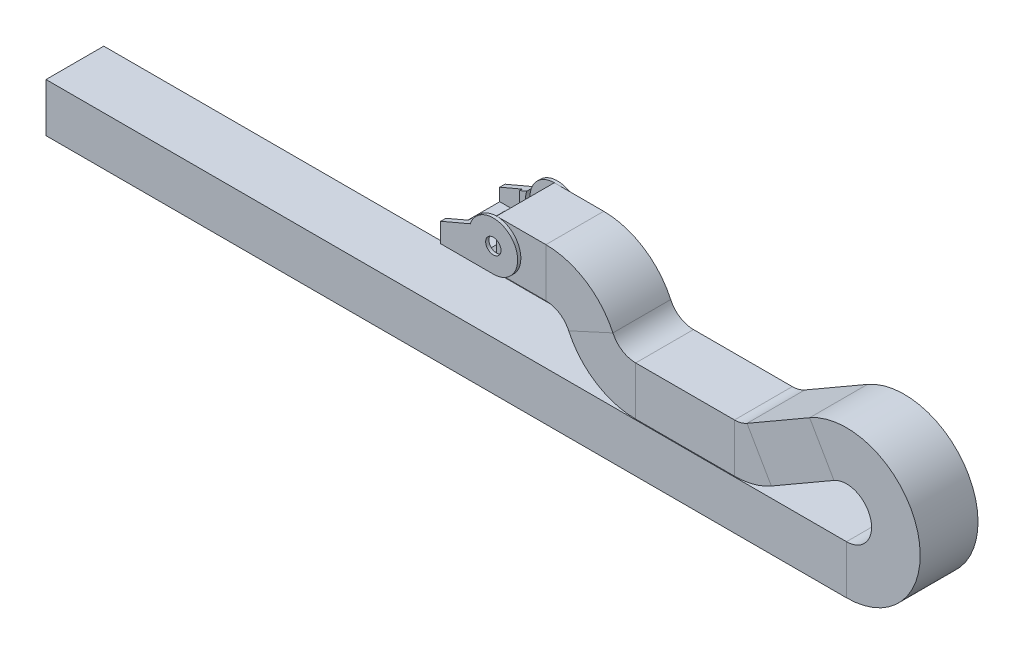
ISO-10303-21;
HEADER;
FILE_DESCRIPTION(('STEP AP214'),'2;1');
FILE_NAME('part.step','',(''),(''),'','','');
FILE_SCHEMA(('AUTOMOTIVE_DESIGN { 1 0 10303 214 1 1 1 1 }'));
ENDSEC;
DATA;
#1=APPLICATION_CONTEXT('core data for automotive mechanical design processes');
#2=APPLICATION_PROTOCOL_DEFINITION('international standard','automotive_design',2000,#1);
#3=PRODUCT_CONTEXT('',#1,'mechanical');
#4=PRODUCT('Part','Part','',(#3));
#5=PRODUCT_RELATED_PRODUCT_CATEGORY('part','',(#4));
#6=PRODUCT_DEFINITION_FORMATION('','',#4);
#7=PRODUCT_DEFINITION_CONTEXT('part definition',#1,'design');
#8=PRODUCT_DEFINITION('design','',#6,#7);
#9=PRODUCT_DEFINITION_SHAPE('','',#8);
#10=(LENGTH_UNIT() NAMED_UNIT(*) SI_UNIT(.MILLI.,.METRE.));
#11=(NAMED_UNIT(*) PLANE_ANGLE_UNIT() SI_UNIT($,.RADIAN.));
#12=(NAMED_UNIT(*) SI_UNIT($,.STERADIAN.) SOLID_ANGLE_UNIT());
#13=UNCERTAINTY_MEASURE_WITH_UNIT(LENGTH_MEASURE(1.E-05),#10,'distance_accuracy_value','');
#14=(GEOMETRIC_REPRESENTATION_CONTEXT(3) GLOBAL_UNCERTAINTY_ASSIGNED_CONTEXT((#13)) GLOBAL_UNIT_ASSIGNED_CONTEXT((#10,
#11,#12)) REPRESENTATION_CONTEXT('',''));
#15=CARTESIAN_POINT('',(0.,0.,0.));
#16=DIRECTION('',(0.,0.,1.));
#17=DIRECTION('',(1.,0.,0.));
#18=AXIS2_PLACEMENT_3D('',#15,#16,#17);
#19=CARTESIAN_POINT('',(0.,0.,29.718));
#20=DIRECTION('',(0.,0.,1.));
#21=DIRECTION('',(1.,0.,0.));
#22=AXIS2_PLACEMENT_3D('',#19,#20,#21);
#23=PLANE('',#22);
#24=DIRECTION('',(0.,-1.,0.));
#25=VECTOR('',#24,1.);
#26=CARTESIAN_POINT('',(-76.2,25.019,29.718));
#27=LINE('',#26,#25);
#28=CARTESIAN_POINT('',(-76.2,-7.874,29.718));
#29=VERTEX_POINT('',#28);
#30=CARTESIAN_POINT('',(-76.2,-25.019,29.718));
#31=VERTEX_POINT('',#30);
#32=EDGE_CURVE('E483',#29,#31,#27,.T.);
#33=ORIENTED_EDGE('',*,*,#32,.T.);
#34=DIRECTION('',(1.,0.,0.));
#35=VECTOR('',#34,1.);
#36=CARTESIAN_POINT('',(-86.6480176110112,-25.019,29.718));
#37=LINE('',#36,#35);
#38=CARTESIAN_POINT('',(-86.6480176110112,-25.019,29.718));
#39=VERTEX_POINT('',#38);
#40=EDGE_CURVE('E620',#39,#31,#37,.T.);
#41=ORIENTED_EDGE('',*,*,#40,.F.);
#42=DIRECTION('',(0.,-1.,0.));
#43=VECTOR('',#42,1.);
#44=CARTESIAN_POINT('',(-86.6480176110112,-22.733,29.718));
#45=LINE('',#44,#43);
#46=CARTESIAN_POINT('',(-86.6480176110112,-22.733,29.718));
#47=VERTEX_POINT('',#46);
#48=EDGE_CURVE('E624',#47,#39,#45,.T.);
#49=ORIENTED_EDGE('',*,*,#48,.F.);
#50=CARTESIAN_POINT('',(-76.2,0.,29.718));
#51=DIRECTION('',(0.,0.,1.));
#52=DIRECTION('',(1.,0.,0.));
#53=AXIS2_PLACEMENT_3D('',#50,#51,#52);
#54=CIRCLE('',#53,25.019);
#55=CARTESIAN_POINT('',(-99.9051547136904,8.001,29.718));
#56=VERTEX_POINT('',#55);
#57=EDGE_CURVE('E629',#56,#47,#54,.T.);
#58=ORIENTED_EDGE('',*,*,#57,.F.);
#59=CARTESIAN_POINT('',(-76.2,25.019,29.718));
#60=VERTEX_POINT('',#59);
#61=EDGE_CURVE('E51',#60,#56,#54,.T.);
#62=ORIENTED_EDGE('',*,*,#61,.F.);
#63=CARTESIAN_POINT('',(-76.2,7.874,29.718));
#64=VERTEX_POINT('',#63);
#65=EDGE_CURVE('E479',#60,#64,#27,.T.);
#66=ORIENTED_EDGE('',*,*,#65,.T.);
#67=CARTESIAN_POINT('',(-76.2,0.,29.718));
#68=DIRECTION('',(0.,0.,1.));
#69=DIRECTION('',(1.,0.,0.));
#70=AXIS2_PLACEMENT_3D('',#67,#68,#69);
#71=CIRCLE('',#70,7.874);
#72=EDGE_CURVE('E605',#64,#29,#71,.T.);
#73=ORIENTED_EDGE('',*,*,#72,.T.);
#74=EDGE_LOOP('',(#33,#41,#49,#58,#62,#66,#73));
#75=FACE_BOUND('',#74,.T.);
#76=ADVANCED_FACE('F35',(#75),#23,.F.);
#77=CARTESIAN_POINT('',(0.,0.,-29.718));
#78=DIRECTION('',(0.,0.,-1.));
#79=DIRECTION('',(1.,0.,0.));
#80=AXIS2_PLACEMENT_3D('',#77,#78,#79);
#81=PLANE('',#80);
#82=DIRECTION('',(0.,1.,0.));
#83=VECTOR('',#82,1.);
#84=CARTESIAN_POINT('',(-76.2,25.019,-29.718));
#85=LINE('',#84,#83);
#86=CARTESIAN_POINT('',(-76.2,7.874,-29.718));
#87=VERTEX_POINT('',#86);
#88=CARTESIAN_POINT('',(-76.2,25.019,-29.718));
#89=VERTEX_POINT('',#88);
#90=EDGE_CURVE('E59',#87,#89,#85,.T.);
#91=ORIENTED_EDGE('',*,*,#90,.T.);
#92=CARTESIAN_POINT('',(-76.2,0.,-29.718));
#93=DIRECTION('',(0.,0.,-1.));
#94=DIRECTION('',(-1.,0.,0.));
#95=AXIS2_PLACEMENT_3D('',#92,#93,#94);
#96=CIRCLE('',#95,25.019);
#97=CARTESIAN_POINT('',(-99.9051547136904,8.001,-29.718));
#98=VERTEX_POINT('',#97);
#99=EDGE_CURVE('E617',#89,#98,#96,.F.);
#100=ORIENTED_EDGE('',*,*,#99,.T.);
#101=CARTESIAN_POINT('',(-86.6480176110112,-22.733,-29.718));
#102=VERTEX_POINT('',#101);
#103=EDGE_CURVE('E618',#98,#102,#96,.F.);
#104=ORIENTED_EDGE('',*,*,#103,.T.);
#105=DIRECTION('',(0.,-1.,0.));
#106=VECTOR('',#105,1.);
#107=CARTESIAN_POINT('',(-86.6480176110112,-22.733,-29.718));
#108=LINE('',#107,#106);
#109=CARTESIAN_POINT('',(-86.6480176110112,-25.019,-29.718));
#110=VERTEX_POINT('',#109);
#111=EDGE_CURVE('E608',#102,#110,#108,.T.);
#112=ORIENTED_EDGE('',*,*,#111,.T.);
#113=DIRECTION('',(1.,0.,0.));
#114=VECTOR('',#113,1.);
#115=CARTESIAN_POINT('',(-86.6480176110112,-25.019,-29.718));
#116=LINE('',#115,#114);
#117=CARTESIAN_POINT('',(-76.2,-25.019,-29.718));
#118=VERTEX_POINT('',#117);
#119=EDGE_CURVE('E612',#110,#118,#116,.T.);
#120=ORIENTED_EDGE('',*,*,#119,.T.);
#121=CARTESIAN_POINT('',(-76.2,-7.874,-29.718));
#122=VERTEX_POINT('',#121);
#123=EDGE_CURVE('E575',#118,#122,#85,.T.);
#124=ORIENTED_EDGE('',*,*,#123,.T.);
#125=CARTESIAN_POINT('',(-76.2,0.,-29.718));
#126=DIRECTION('',(0.,0.,-1.));
#127=DIRECTION('',(-1.,0.,0.));
#128=AXIS2_PLACEMENT_3D('',#125,#126,#127);
#129=CIRCLE('',#128,7.874);
#130=EDGE_CURVE('E602',#122,#87,#129,.T.);
#131=ORIENTED_EDGE('',*,*,#130,.T.);
#132=EDGE_LOOP('',(#91,#100,#104,#112,#120,#124,#131));
#133=FACE_BOUND('',#132,.T.);
#134=ADVANCED_FACE('F915',(#133),#81,.F.);
#135=CARTESIAN_POINT('',(-107.188,-17.907,65.4898962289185));
#136=DIRECTION('',(0.,1.,0.));
#137=DIRECTION('',(0.,0.,1.));
#138=AXIS2_PLACEMENT_3D('',#135,#136,#137);
#139=PLANE('',#138);
#140=DIRECTION('',(0.,0.,-1.));
#141=VECTOR('',#140,1.);
#142=CARTESIAN_POINT('',(-107.188,-17.907,20.701));
#143=LINE('',#142,#141);
#144=CARTESIAN_POINT('',(-107.188,-17.907,20.701));
#145=VERTEX_POINT('',#144);
#146=CARTESIAN_POINT('',(-107.188,-17.907,9.27100000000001));
#147=VERTEX_POINT('',#146);
#148=EDGE_CURVE('E703',#145,#147,#143,.T.);
#149=ORIENTED_EDGE('',*,*,#148,.F.);
#150=CARTESIAN_POINT('',(-113.284,-17.907,20.701));
#151=DIRECTION('',(0.,-1.,0.));
#152=DIRECTION('',(0.,0.,1.));
#153=AXIS2_PLACEMENT_3D('',#150,#151,#152);
#154=CIRCLE('',#153,6.09600000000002);
#155=CARTESIAN_POINT('',(-119.38,-17.907,20.701));
#156=VERTEX_POINT('',#155);
#157=EDGE_CURVE('E712',#156,#145,#154,.F.);
#158=ORIENTED_EDGE('',*,*,#157,.F.);
#159=DIRECTION('',(0.,0.,1.));
#160=VECTOR('',#159,1.);
#161=CARTESIAN_POINT('',(-119.38,-17.907,9.27100000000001));
#162=LINE('',#161,#160);
#163=CARTESIAN_POINT('',(-119.38,-17.907,9.27100000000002));
#164=VERTEX_POINT('',#163);
#165=EDGE_CURVE('E717',#164,#156,#162,.T.);
#166=ORIENTED_EDGE('',*,*,#165,.F.);
#167=CARTESIAN_POINT('',(-113.284,-17.907,9.271));
#168=DIRECTION('',(0.,-1.,0.));
#169=DIRECTION('',(0.,0.,1.));
#170=AXIS2_PLACEMENT_3D('',#167,#168,#169);
#171=CIRCLE('',#170,6.09600000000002);
#172=EDGE_CURVE('E721',#147,#164,#171,.F.);
#173=ORIENTED_EDGE('',*,*,#172,.F.);
#174=EDGE_LOOP('',(#149,#158,#166,#173));
#175=FACE_BOUND('',#174,.T.);
#176=DIRECTION('',(0.,0.,-1.));
#177=VECTOR('',#176,1.);
#178=CARTESIAN_POINT('',(-107.188,-17.907,-20.701));
#179=LINE('',#178,#177);
#180=CARTESIAN_POINT('',(-107.188,-17.907,-20.701));
#181=VERTEX_POINT('',#180);
#182=CARTESIAN_POINT('',(-107.188,-17.907,-9.27100000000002));
#183=VERTEX_POINT('',#182);
#184=EDGE_CURVE('E661',#181,#183,#179,.F.);
#185=ORIENTED_EDGE('',*,*,#184,.T.);
#186=CARTESIAN_POINT('',(-113.284,-17.907,-9.271));
#187=DIRECTION('',(0.,-1.,0.));
#188=DIRECTION('',(0.,0.,1.));
#189=AXIS2_PLACEMENT_3D('',#186,#187,#188);
#190=CIRCLE('',#189,6.09600000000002);
#191=CARTESIAN_POINT('',(-119.38,-17.907,-9.27100000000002));
#192=VERTEX_POINT('',#191);
#193=EDGE_CURVE('E657',#183,#192,#190,.T.);
#194=ORIENTED_EDGE('',*,*,#193,.T.);
#195=DIRECTION('',(0.,0.,1.));
#196=VECTOR('',#195,1.);
#197=CARTESIAN_POINT('',(-119.38,-17.907,-9.27100000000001));
#198=LINE('',#197,#196);
#199=CARTESIAN_POINT('',(-119.38,-17.907,-20.701));
#200=VERTEX_POINT('',#199);
#201=EDGE_CURVE('E667',#192,#200,#198,.F.);
#202=ORIENTED_EDGE('',*,*,#201,.T.);
#203=CARTESIAN_POINT('',(-113.284,-17.907,-20.701));
#204=DIRECTION('',(0.,-1.,0.));
#205=DIRECTION('',(0.,0.,1.));
#206=AXIS2_PLACEMENT_3D('',#203,#204,#205);
#207=CIRCLE('',#206,6.09600000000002);
#208=EDGE_CURVE('E664',#200,#181,#207,.T.);
#209=ORIENTED_EDGE('',*,*,#208,.T.);
#210=EDGE_LOOP('',(#185,#194,#202,#209));
#211=FACE_BOUND('',#210,.T.);
#212=DIRECTION('',(-1.,0.,0.));
#213=VECTOR('',#212,1.);
#214=CARTESIAN_POINT('',(-90.424,-17.907,25.019));
#215=LINE('',#214,#213);
#216=CARTESIAN_POINT('',(-93.6725416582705,-17.907,25.019));
#217=VERTEX_POINT('',#216);
#218=CARTESIAN_POINT('',(-107.188,-17.907,25.019));
#219=VERTEX_POINT('',#218);
#220=EDGE_CURVE('E804',#217,#219,#215,.T.);
#221=ORIENTED_EDGE('',*,*,#220,.F.);
#222=DIRECTION('',(0.,0.,-1.));
#223=VECTOR('',#222,1.);
#224=CARTESIAN_POINT('',(-93.6725416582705,-17.907,100.482418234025));
#225=LINE('',#224,#223);
#226=CARTESIAN_POINT('',(-93.6725416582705,-17.907,-25.019));
#227=VERTEX_POINT('',#226);
#228=EDGE_CURVE('E623',#217,#227,#225,.T.);
#229=ORIENTED_EDGE('',*,*,#228,.T.);
#230=DIRECTION('',(-1.,0.,0.));
#231=VECTOR('',#230,1.);
#232=CARTESIAN_POINT('',(-90.424,-17.907,-25.019));
#233=LINE('',#232,#231);
#234=CARTESIAN_POINT('',(-107.188,-17.907,-25.019));
#235=VERTEX_POINT('',#234);
#236=EDGE_CURVE('E794',#227,#235,#233,.T.);
#237=ORIENTED_EDGE('',*,*,#236,.T.);
#238=DIRECTION('',(0.,0.,-1.));
#239=VECTOR('',#238,1.);
#240=CARTESIAN_POINT('',(-107.188,-17.907,65.4898962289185));
#241=LINE('',#240,#239);
#242=CARTESIAN_POINT('',(-107.188,-17.907,-27.686));
#243=VERTEX_POINT('',#242);
#244=EDGE_CURVE('E843',#235,#243,#241,.T.);
#245=ORIENTED_EDGE('',*,*,#244,.T.);
#246=DIRECTION('',(1.,0.,0.));
#247=VECTOR('',#246,1.);
#248=CARTESIAN_POINT('',(-107.188,-17.907,-27.686));
#249=LINE('',#248,#247);
#250=CARTESIAN_POINT('',(-130.302,-17.907,-27.686));
#251=VERTEX_POINT('',#250);
#252=EDGE_CURVE('E816',#251,#243,#249,.T.);
#253=ORIENTED_EDGE('',*,*,#252,.F.);
#254=DIRECTION('',(0.,0.,-1.));
#255=VECTOR('',#254,1.);
#256=CARTESIAN_POINT('',(-130.302,-17.907,65.4898962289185));
#257=LINE('',#256,#255);
#258=CARTESIAN_POINT('',(-130.302,-17.907,27.686));
#259=VERTEX_POINT('',#258);
#260=EDGE_CURVE('E839',#259,#251,#257,.T.);
#261=ORIENTED_EDGE('',*,*,#260,.F.);
#262=DIRECTION('',(-1.,0.,0.));
#263=VECTOR('',#262,1.);
#264=CARTESIAN_POINT('',(-107.188,-17.907,27.686));
#265=LINE('',#264,#263);
#266=CARTESIAN_POINT('',(-107.188,-17.907,27.686));
#267=VERTEX_POINT('',#266);
#268=EDGE_CURVE('E827',#267,#259,#265,.T.);
#269=ORIENTED_EDGE('',*,*,#268,.F.);
#270=EDGE_CURVE('E844',#267,#219,#241,.T.);
#271=ORIENTED_EDGE('',*,*,#270,.T.);
#272=EDGE_LOOP('',(#221,#229,#237,#245,#253,#261,#269,#271));
#273=FACE_BOUND('',#272,.T.);
#274=ADVANCED_FACE('F983',(#175,#211,#273),#139,.T.);
#275=CARTESIAN_POINT('',(-76.2,-25.019,33.02));
#276=DIRECTION('',(0.,1.,0.));
#277=DIRECTION('',(0.,0.,1.));
#278=AXIS2_PLACEMENT_3D('',#275,#276,#277);
#279=PLANE('',#278);
#280=DIRECTION('',(0.,0.,-1.));
#281=VECTOR('',#280,1.);
#282=CARTESIAN_POINT('',(-110.236,-25.019,20.701));
#283=LINE('',#282,#281);
#284=CARTESIAN_POINT('',(-110.236,-25.019,20.701));
#285=VERTEX_POINT('',#284);
#286=CARTESIAN_POINT('',(-110.236,-25.019,9.27100000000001));
#287=VERTEX_POINT('',#286);
#288=EDGE_CURVE('E745',#285,#287,#283,.T.);
#289=ORIENTED_EDGE('',*,*,#288,.T.);
#290=CARTESIAN_POINT('',(-113.284,-25.019,9.271));
#291=DIRECTION('',(0.,1.,0.));
#292=DIRECTION('',(0.,0.,-1.));
#293=AXIS2_PLACEMENT_3D('',#290,#291,#292);
#294=CIRCLE('',#293,3.04800000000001);
#295=CARTESIAN_POINT('',(-116.332,-25.019,9.27100000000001));
#296=VERTEX_POINT('',#295);
#297=EDGE_CURVE('E748',#287,#296,#294,.T.);
#298=ORIENTED_EDGE('',*,*,#297,.T.);
#299=DIRECTION('',(0.,0.,1.));
#300=VECTOR('',#299,1.);
#301=CARTESIAN_POINT('',(-116.332,-25.019,20.701));
#302=LINE('',#301,#300);
#303=CARTESIAN_POINT('',(-116.332,-25.019,20.701));
#304=VERTEX_POINT('',#303);
#305=EDGE_CURVE('E733',#296,#304,#302,.T.);
#306=ORIENTED_EDGE('',*,*,#305,.T.);
#307=CARTESIAN_POINT('',(-113.284,-25.019,20.701));
#308=DIRECTION('',(0.,1.,0.));
#309=DIRECTION('',(0.,0.,-1.));
#310=AXIS2_PLACEMENT_3D('',#307,#308,#309);
#311=CIRCLE('',#310,3.04800000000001);
#312=EDGE_CURVE('E728',#304,#285,#311,.T.);
#313=ORIENTED_EDGE('',*,*,#312,.T.);
#314=EDGE_LOOP('',(#289,#298,#306,#313));
#315=FACE_BOUND('',#314,.T.);
#316=CARTESIAN_POINT('',(-113.284,-25.019,-20.701));
#317=DIRECTION('',(0.,-1.,0.));
#318=DIRECTION('',(0.,0.,1.));
#319=AXIS2_PLACEMENT_3D('',#316,#317,#318);
#320=CIRCLE('',#319,3.04800000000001);
#321=CARTESIAN_POINT('',(-116.332,-25.019,-20.701));
#322=VERTEX_POINT('',#321);
#323=CARTESIAN_POINT('',(-110.236,-25.019,-20.701));
#324=VERTEX_POINT('',#323);
#325=EDGE_CURVE('E660',#322,#324,#320,.T.);
#326=ORIENTED_EDGE('',*,*,#325,.F.);
#327=DIRECTION('',(0.,0.,-1.));
#328=VECTOR('',#327,1.);
#329=CARTESIAN_POINT('',(-116.332,-25.019,-20.701));
#330=LINE('',#329,#328);
#331=CARTESIAN_POINT('',(-116.332,-25.019,-9.27100000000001));
#332=VERTEX_POINT('',#331);
#333=EDGE_CURVE('E693',#332,#322,#330,.T.);
#334=ORIENTED_EDGE('',*,*,#333,.F.);
#335=CARTESIAN_POINT('',(-113.284,-25.019,-9.271));
#336=DIRECTION('',(0.,-1.,0.));
#337=DIRECTION('',(0.,0.,1.));
#338=AXIS2_PLACEMENT_3D('',#335,#336,#337);
#339=CIRCLE('',#338,3.04800000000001);
#340=CARTESIAN_POINT('',(-110.236,-25.019,-9.27100000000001));
#341=VERTEX_POINT('',#340);
#342=EDGE_CURVE('E696',#341,#332,#339,.T.);
#343=ORIENTED_EDGE('',*,*,#342,.F.);
#344=DIRECTION('',(0.,0.,1.));
#345=VECTOR('',#344,1.);
#346=CARTESIAN_POINT('',(-110.236,-25.019,-20.701));
#347=LINE('',#346,#345);
#348=EDGE_CURVE('E681',#324,#341,#347,.T.);
#349=ORIENTED_EDGE('',*,*,#348,.F.);
#350=EDGE_LOOP('',(#326,#334,#343,#349));
#351=FACE_BOUND('',#350,.T.);
#352=DIRECTION('',(0.,0.,-1.));
#353=VECTOR('',#352,1.);
#354=CARTESIAN_POINT('',(-86.6480176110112,-25.019,100.482418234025));
#355=LINE('',#354,#353);
#356=CARTESIAN_POINT('',(-86.6480176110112,-25.019,25.019));
#357=VERTEX_POINT('',#356);
#358=EDGE_CURVE('E634',#39,#357,#355,.T.);
#359=ORIENTED_EDGE('',*,*,#358,.F.);
#360=ORIENTED_EDGE('',*,*,#40,.T.);
#361=DIRECTION('',(0.,0.,-1.));
#362=VECTOR('',#361,1.);
#363=CARTESIAN_POINT('',(-76.2,-25.019,33.02));
#364=LINE('',#363,#362);
#365=CARTESIAN_POINT('',(-76.2,-25.019,33.02));
#366=VERTEX_POINT('',#365);
#367=EDGE_CURVE('E880',#366,#31,#364,.T.);
#368=ORIENTED_EDGE('',*,*,#367,.F.);
#369=DIRECTION('',(-1.,0.,0.));
#370=VECTOR('',#369,1.);
#371=CARTESIAN_POINT('',(-76.2,-25.019,33.02));
#372=LINE('',#371,#370);
#373=CARTESIAN_POINT('',(-130.302,-25.019,33.02));
#374=VERTEX_POINT('',#373);
#375=EDGE_CURVE('E849',#366,#374,#372,.T.);
#376=ORIENTED_EDGE('',*,*,#375,.T.);
#377=DIRECTION('',(0.,0.,-1.));
#378=VECTOR('',#377,1.);
#379=CARTESIAN_POINT('',(-130.302,-25.019,33.02));
#380=LINE('',#379,#378);
#381=CARTESIAN_POINT('',(-130.302,-25.019,27.686));
#382=VERTEX_POINT('',#381);
#383=EDGE_CURVE('E876',#374,#382,#380,.T.);
#384=ORIENTED_EDGE('',*,*,#383,.T.);
#385=DIRECTION('',(1.,0.,0.));
#386=VECTOR('',#385,1.);
#387=CARTESIAN_POINT('',(-120.396,-25.019,27.686));
#388=LINE('',#387,#386);
#389=CARTESIAN_POINT('',(-120.396,-25.019,27.686));
#390=VERTEX_POINT('',#389);
#391=EDGE_CURVE('E765',#382,#390,#388,.T.);
#392=ORIENTED_EDGE('',*,*,#391,.T.);
#393=DIRECTION('',(0.,0.,-1.));
#394=VECTOR('',#393,1.);
#395=CARTESIAN_POINT('',(-120.396,-25.019,-27.686));
#396=LINE('',#395,#394);
#397=CARTESIAN_POINT('',(-120.396,-25.019,-27.686));
#398=VERTEX_POINT('',#397);
#399=EDGE_CURVE('E755',#390,#398,#396,.T.);
#400=ORIENTED_EDGE('',*,*,#399,.T.);
#401=DIRECTION('',(-1.,0.,0.));
#402=VECTOR('',#401,1.);
#403=CARTESIAN_POINT('',(-120.396,-25.019,-27.686));
#404=LINE('',#403,#402);
#405=CARTESIAN_POINT('',(-130.302,-25.019,-27.686));
#406=VERTEX_POINT('',#405);
#407=EDGE_CURVE('E775',#398,#406,#404,.T.);
#408=ORIENTED_EDGE('',*,*,#407,.T.);
#409=CARTESIAN_POINT('',(-130.302,-25.019,-33.02));
#410=VERTEX_POINT('',#409);
#411=EDGE_CURVE('E875',#406,#410,#380,.T.);
#412=ORIENTED_EDGE('',*,*,#411,.T.);
#413=DIRECTION('',(-1.,0.,0.));
#414=VECTOR('',#413,1.);
#415=CARTESIAN_POINT('',(-76.2,-25.019,-33.02));
#416=LINE('',#415,#414);
#417=CARTESIAN_POINT('',(-76.2,-25.019,-33.02));
#418=VERTEX_POINT('',#417);
#419=EDGE_CURVE('E830',#418,#410,#416,.T.);
#420=ORIENTED_EDGE('',*,*,#419,.F.);
#421=EDGE_CURVE('E879',#118,#418,#364,.T.);
#422=ORIENTED_EDGE('',*,*,#421,.F.);
#423=ORIENTED_EDGE('',*,*,#119,.F.);
#424=CARTESIAN_POINT('',(-86.6480176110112,-25.019,-25.019));
#425=VERTEX_POINT('',#424);
#426=EDGE_CURVE('E633',#425,#110,#355,.T.);
#427=ORIENTED_EDGE('',*,*,#426,.F.);
#428=DIRECTION('',(-1.,0.,0.));
#429=VECTOR('',#428,1.);
#430=CARTESIAN_POINT('',(-76.2,-25.019,-25.019));
#431=LINE('',#430,#429);
#432=CARTESIAN_POINT('',(-90.424,-25.019,-25.019));
#433=VERTEX_POINT('',#432);
#434=EDGE_CURVE('E788',#425,#433,#431,.T.);
#435=ORIENTED_EDGE('',*,*,#434,.T.);
#436=DIRECTION('',(0.,0.,1.));
#437=VECTOR('',#436,1.);
#438=CARTESIAN_POINT('',(-90.424,-25.019,-25.019));
#439=LINE('',#438,#437);
#440=CARTESIAN_POINT('',(-90.424,-25.019,25.019));
#441=VERTEX_POINT('',#440);
#442=EDGE_CURVE('E799',#433,#441,#439,.T.);
#443=ORIENTED_EDGE('',*,*,#442,.T.);
#444=DIRECTION('',(-1.,0.,0.));
#445=VECTOR('',#444,1.);
#446=CARTESIAN_POINT('',(-76.2,-25.019,25.019));
#447=LINE('',#446,#445);
#448=EDGE_CURVE('E782',#357,#441,#447,.T.);
#449=ORIENTED_EDGE('',*,*,#448,.F.);
#450=EDGE_LOOP('',(#359,#360,#368,#376,#384,#392,#400,#408,#412,#420,#422,#423,#427,#435,#443,#449));
#451=FACE_BOUND('',#450,.T.);
#452=ADVANCED_FACE('F903',(#315,#351,#451),#279,.F.);
#453=CARTESIAN_POINT('',(-90.424,-25.019,-25.019));
#454=DIRECTION('',(-1.,0.,0.));
#455=DIRECTION('',(0.,0.,-1.));
#456=AXIS2_PLACEMENT_3D('',#453,#454,#455);
#457=PLANE('',#456);
#458=DIRECTION('',(0.,0.,-1.));
#459=VECTOR('',#458,1.);
#460=CARTESIAN_POINT('',(-90.424,-20.5822298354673,100.482418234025));
#461=LINE('',#460,#459);
#462=CARTESIAN_POINT('',(-90.424,-20.5822298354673,25.019));
#463=VERTEX_POINT('',#462);
#464=CARTESIAN_POINT('',(-90.424,-20.5822298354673,-25.019));
#465=VERTEX_POINT('',#464);
#466=EDGE_CURVE('E641',#463,#465,#461,.T.);
#467=ORIENTED_EDGE('',*,*,#466,.F.);
#468=DIRECTION('',(0.,1.,0.));
#469=VECTOR('',#468,1.);
#470=CARTESIAN_POINT('',(-90.424,-25.019,25.019));
#471=LINE('',#470,#469);
#472=EDGE_CURVE('E801',#441,#463,#471,.T.);
#473=ORIENTED_EDGE('',*,*,#472,.F.);
#474=ORIENTED_EDGE('',*,*,#442,.F.);
#475=DIRECTION('',(0.,1.,0.));
#476=VECTOR('',#475,1.);
#477=CARTESIAN_POINT('',(-90.424,-25.019,-25.019));
#478=LINE('',#477,#476);
#479=EDGE_CURVE('E790',#433,#465,#478,.T.);
#480=ORIENTED_EDGE('',*,*,#479,.T.);
#481=EDGE_LOOP('',(#467,#473,#474,#480));
#482=FACE_BOUND('',#481,.T.);
#483=ADVANCED_FACE('F896',(#482),#457,.F.);
#484=CARTESIAN_POINT('',(-76.2,0.,-25.019));
#485=DIRECTION('',(0.,0.,1.));
#486=DIRECTION('',(-1.,0.,0.));
#487=AXIS2_PLACEMENT_3D('',#484,#485,#486);
#488=PLANE('',#487);
#489=ORIENTED_EDGE('',*,*,#434,.F.);
#490=DIRECTION('',(0.,1.,0.));
#491=VECTOR('',#490,1.);
#492=CARTESIAN_POINT('',(-86.6480176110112,0.,-25.019));
#493=LINE('',#492,#491);
#494=CARTESIAN_POINT('',(-86.6480176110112,-22.733,-25.019));
#495=VERTEX_POINT('',#494);
#496=EDGE_CURVE('E647',#425,#495,#493,.T.);
#497=ORIENTED_EDGE('',*,*,#496,.T.);
#498=CARTESIAN_POINT('',(-76.2,0.,-25.019));
#499=DIRECTION('',(0.,0.,1.));
#500=DIRECTION('',(1.,0.,0.));
#501=AXIS2_PLACEMENT_3D('',#498,#499,#500);
#502=CIRCLE('',#501,25.019);
#503=EDGE_CURVE('E642',#495,#465,#502,.F.);
#504=ORIENTED_EDGE('',*,*,#503,.T.);
#505=ORIENTED_EDGE('',*,*,#479,.F.);
#506=EDGE_LOOP('',(#489,#497,#504,#505));
#507=FACE_BOUND('',#506,.T.);
#508=ADVANCED_FACE('F908',(#507),#488,.T.);
#509=ORIENTED_EDGE('',*,*,#236,.F.);
#510=CARTESIAN_POINT('',(-99.9051547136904,8.001,-25.019));
#511=VERTEX_POINT('',#510);
#512=EDGE_CURVE('E638',#227,#511,#502,.F.);
#513=ORIENTED_EDGE('',*,*,#512,.T.);
#514=DIRECTION('',(0.919945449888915,0.392046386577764,0.));
#515=VECTOR('',#514,1.);
#516=CARTESIAN_POINT('',(-130.302,-4.953,-25.019));
#517=LINE('',#516,#515);
#518=CARTESIAN_POINT('',(-107.188,4.89732338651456,-25.019));
#519=VERTEX_POINT('',#518);
#520=EDGE_CURVE('E796',#519,#511,#517,.T.);
#521=ORIENTED_EDGE('',*,*,#520,.F.);
#522=DIRECTION('',(0.,-1.,0.));
#523=VECTOR('',#522,1.);
#524=CARTESIAN_POINT('',(-107.188,4.89732338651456,-25.019));
#525=LINE('',#524,#523);
#526=EDGE_CURVE('E813',#519,#235,#525,.T.);
#527=ORIENTED_EDGE('',*,*,#526,.T.);
#528=EDGE_LOOP('',(#509,#513,#521,#527));
#529=FACE_BOUND('',#528,.T.);
#530=ADVANCED_FACE('F1072',(#529),#488,.T.);
#531=CARTESIAN_POINT('',(-76.2,0.,25.019));
#532=DIRECTION('',(0.,0.,1.));
#533=DIRECTION('',(-1.,0.,0.));
#534=AXIS2_PLACEMENT_3D('',#531,#532,#533);
#535=PLANE('',#534);
#536=DIRECTION('',(0.,1.,0.));
#537=VECTOR('',#536,1.);
#538=CARTESIAN_POINT('',(-86.6480176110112,0.,25.019));
#539=LINE('',#538,#537);
#540=CARTESIAN_POINT('',(-86.6480176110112,-22.733,25.019));
#541=VERTEX_POINT('',#540);
#542=EDGE_CURVE('E12',#357,#541,#539,.T.);
#543=ORIENTED_EDGE('',*,*,#542,.F.);
#544=ORIENTED_EDGE('',*,*,#448,.T.);
#545=ORIENTED_EDGE('',*,*,#472,.T.);
#546=CARTESIAN_POINT('',(-76.2,0.,25.019));
#547=DIRECTION('',(0.,0.,1.));
#548=DIRECTION('',(1.,0.,0.));
#549=AXIS2_PLACEMENT_3D('',#546,#547,#548);
#550=CIRCLE('',#549,25.019);
#551=EDGE_CURVE('E44',#541,#463,#550,.F.);
#552=ORIENTED_EDGE('',*,*,#551,.F.);
#553=EDGE_LOOP('',(#543,#544,#545,#552));
#554=FACE_BOUND('',#553,.T.);
#555=ADVANCED_FACE('F899',(#554),#535,.F.);
#556=CARTESIAN_POINT('',(-99.9051547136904,8.001,25.019));
#557=VERTEX_POINT('',#556);
#558=EDGE_CURVE('E883',#217,#557,#550,.F.);
#559=ORIENTED_EDGE('',*,*,#558,.F.);
#560=ORIENTED_EDGE('',*,*,#220,.T.);
#561=DIRECTION('',(0.,-1.,0.));
#562=VECTOR('',#561,1.);
#563=CARTESIAN_POINT('',(-107.188,4.89732338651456,25.019));
#564=LINE('',#563,#562);
#565=CARTESIAN_POINT('',(-107.188,4.89732338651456,25.019));
#566=VERTEX_POINT('',#565);
#567=EDGE_CURVE('E810',#566,#219,#564,.T.);
#568=ORIENTED_EDGE('',*,*,#567,.F.);
#569=DIRECTION('',(0.919945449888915,0.392046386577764,0.));
#570=VECTOR('',#569,1.);
#571=CARTESIAN_POINT('',(-130.302,-4.953,25.019));
#572=LINE('',#571,#570);
#573=EDGE_CURVE('E791',#566,#557,#572,.T.);
#574=ORIENTED_EDGE('',*,*,#573,.T.);
#575=EDGE_LOOP('',(#559,#560,#568,#574));
#576=FACE_BOUND('',#575,.T.);
#577=ADVANCED_FACE('F1075',(#576),#535,.F.);
#578=CARTESIAN_POINT('',(-76.2,0.,33.02));
#579=DIRECTION('',(0.,0.,-1.));
#580=DIRECTION('',(1.,0.,0.));
#581=AXIS2_PLACEMENT_3D('',#578,#579,#580);
#582=CYLINDRICAL_SURFACE('',#581,25.019);
#583=DIRECTION('',(0.,0.,-1.));
#584=VECTOR('',#583,1.);
#585=CARTESIAN_POINT('',(-99.9051547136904,8.001,33.02));
#586=LINE('',#585,#584);
#587=CARTESIAN_POINT('',(-99.9051547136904,8.001,-33.02));
#588=VERTEX_POINT('',#587);
#589=EDGE_CURVE('E859',#98,#588,#586,.T.);
#590=ORIENTED_EDGE('',*,*,#589,.F.);
#591=ORIENTED_EDGE('',*,*,#99,.F.);
#592=EDGE_CURVE('E613',#118,#89,#96,.F.);
#593=ORIENTED_EDGE('',*,*,#592,.F.);
#594=ORIENTED_EDGE('',*,*,#421,.T.);
#595=CARTESIAN_POINT('',(-76.2,0.,-33.02));
#596=DIRECTION('',(0.,0.,1.));
#597=DIRECTION('',(1.,0.,0.));
#598=AXIS2_PLACEMENT_3D('',#595,#596,#597);
#599=CIRCLE('',#598,25.019);
#600=EDGE_CURVE('E650',#418,#588,#599,.T.);
#601=ORIENTED_EDGE('',*,*,#600,.T.);
#602=EDGE_LOOP('',(#590,#591,#593,#594,#601));
#603=FACE_BOUND('',#602,.T.);
#604=ADVANCED_FACE('F1541',(#603),#582,.T.);
#605=ORIENTED_EDGE('',*,*,#367,.T.);
#606=EDGE_CURVE('E627',#31,#60,#54,.T.);
#607=ORIENTED_EDGE('',*,*,#606,.T.);
#608=ORIENTED_EDGE('',*,*,#61,.T.);
#609=CARTESIAN_POINT('',(-99.9051547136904,8.001,33.02));
#610=VERTEX_POINT('',#609);
#611=EDGE_CURVE('E867',#610,#56,#586,.T.);
#612=ORIENTED_EDGE('',*,*,#611,.F.);
#613=CARTESIAN_POINT('',(-76.2,0.,33.02));
#614=DIRECTION('',(0.,0.,1.));
#615=DIRECTION('',(1.,0.,0.));
#616=AXIS2_PLACEMENT_3D('',#613,#614,#615);
#617=CIRCLE('',#616,25.019);
#618=EDGE_CURVE('E653',#366,#610,#617,.T.);
#619=ORIENTED_EDGE('',*,*,#618,.F.);
#620=EDGE_LOOP('',(#605,#607,#608,#612,#619));
#621=FACE_BOUND('',#620,.T.);
#622=ADVANCED_FACE('F37',(#621),#582,.T.);
#623=CARTESIAN_POINT('',(-130.302,-4.953,33.02));
#624=DIRECTION('',(0.392046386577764,-0.919945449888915,0.));
#625=DIRECTION('',(-0.919945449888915,-0.392046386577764,0.));
#626=AXIS2_PLACEMENT_3D('',#623,#624,#625);
#627=PLANE('',#626);
#628=ORIENTED_EDGE('',*,*,#520,.T.);
#629=EDGE_CURVE('E871',#511,#98,#586,.T.);
#630=ORIENTED_EDGE('',*,*,#629,.T.);
#631=ORIENTED_EDGE('',*,*,#589,.T.);
#632=DIRECTION('',(0.919945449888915,0.392046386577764,0.));
#633=VECTOR('',#632,1.);
#634=CARTESIAN_POINT('',(-130.302,-4.953,-33.02));
#635=LINE('',#634,#633);
#636=CARTESIAN_POINT('',(-130.302,-4.953,-33.02));
#637=VERTEX_POINT('',#636);
#638=EDGE_CURVE('E853',#637,#588,#635,.T.);
#639=ORIENTED_EDGE('',*,*,#638,.F.);
#640=DIRECTION('',(0.,0.,-1.));
#641=VECTOR('',#640,1.);
#642=CARTESIAN_POINT('',(-130.302,-4.953,33.02));
#643=LINE('',#642,#641);
#644=CARTESIAN_POINT('',(-130.302,-4.953,-27.686));
#645=VERTEX_POINT('',#644);
#646=EDGE_CURVE('E870',#645,#637,#643,.T.);
#647=ORIENTED_EDGE('',*,*,#646,.F.);
#648=DIRECTION('',(-0.919945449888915,-0.392046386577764,0.));
#649=VECTOR('',#648,1.);
#650=CARTESIAN_POINT('',(-130.302,-4.953,-27.686));
#651=LINE('',#650,#649);
#652=CARTESIAN_POINT('',(-107.188,4.89732338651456,-27.686));
#653=VERTEX_POINT('',#652);
#654=EDGE_CURVE('E821',#653,#645,#651,.T.);
#655=ORIENTED_EDGE('',*,*,#654,.F.);
#656=DIRECTION('',(0.,0.,-1.));
#657=VECTOR('',#656,1.);
#658=CARTESIAN_POINT('',(-107.188,4.89732338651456,65.4898962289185));
#659=LINE('',#658,#657);
#660=EDGE_CURVE('E826',#519,#653,#659,.T.);
#661=ORIENTED_EDGE('',*,*,#660,.F.);
#662=EDGE_LOOP('',(#628,#630,#631,#639,#647,#655,#661));
#663=FACE_BOUND('',#662,.T.);
#664=ADVANCED_FACE('F1106',(#663),#627,.F.);
#665=CARTESIAN_POINT('',(-107.188,4.89732338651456,65.4898962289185));
#666=DIRECTION('',(-1.,0.,0.));
#667=DIRECTION('',(0.,1.,0.));
#668=AXIS2_PLACEMENT_3D('',#665,#666,#667);
#669=PLANE('',#668);
#670=ORIENTED_EDGE('',*,*,#660,.T.);
#671=DIRECTION('',(0.,1.,0.));
#672=VECTOR('',#671,1.);
#673=CARTESIAN_POINT('',(-107.188,4.89732338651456,-27.686));
#674=LINE('',#673,#672);
#675=EDGE_CURVE('E824',#243,#653,#674,.T.);
#676=ORIENTED_EDGE('',*,*,#675,.F.);
#677=ORIENTED_EDGE('',*,*,#244,.F.);
#678=ORIENTED_EDGE('',*,*,#526,.F.);
#679=EDGE_LOOP('',(#670,#676,#677,#678));
#680=FACE_BOUND('',#679,.T.);
#681=ADVANCED_FACE('F1090',(#680),#669,.T.);
#682=CARTESIAN_POINT('',(-130.302,-25.019,33.02));
#683=DIRECTION('',(1.,0.,0.));
#684=DIRECTION('',(0.,0.,1.));
#685=AXIS2_PLACEMENT_3D('',#682,#683,#684);
#686=PLANE('',#685);
#687=ORIENTED_EDGE('',*,*,#383,.F.);
#688=DIRECTION('',(0.,1.,0.));
#689=VECTOR('',#688,1.);
#690=CARTESIAN_POINT('',(-130.302,-25.019,33.02));
#691=LINE('',#690,#689);
#692=CARTESIAN_POINT('',(-130.302,-4.953,33.02));
#693=VERTEX_POINT('',#692);
#694=EDGE_CURVE('E852',#374,#693,#691,.T.);
#695=ORIENTED_EDGE('',*,*,#694,.T.);
#696=CARTESIAN_POINT('',(-130.302,-4.953,27.686));
#697=VERTEX_POINT('',#696);
#698=EDGE_CURVE('E872',#693,#697,#643,.T.);
#699=ORIENTED_EDGE('',*,*,#698,.T.);
#700=DIRECTION('',(0.,1.,0.));
#701=VECTOR('',#700,1.);
#702=CARTESIAN_POINT('',(-130.302,-17.907,27.686));
#703=LINE('',#702,#701);
#704=EDGE_CURVE('E836',#259,#697,#703,.T.);
#705=ORIENTED_EDGE('',*,*,#704,.F.);
#706=ORIENTED_EDGE('',*,*,#260,.T.);
#707=DIRECTION('',(0.,-1.,0.));
#708=VECTOR('',#707,1.);
#709=CARTESIAN_POINT('',(-130.302,-17.907,-27.686));
#710=LINE('',#709,#708);
#711=EDGE_CURVE('E819',#645,#251,#710,.T.);
#712=ORIENTED_EDGE('',*,*,#711,.F.);
#713=ORIENTED_EDGE('',*,*,#646,.T.);
#714=DIRECTION('',(0.,1.,0.));
#715=VECTOR('',#714,1.);
#716=CARTESIAN_POINT('',(-130.302,-25.019,-33.02));
#717=LINE('',#716,#715);
#718=EDGE_CURVE('E862',#410,#637,#717,.T.);
#719=ORIENTED_EDGE('',*,*,#718,.F.);
#720=ORIENTED_EDGE('',*,*,#411,.F.);
#721=DIRECTION('',(0.,-1.,0.));
#722=VECTOR('',#721,1.);
#723=CARTESIAN_POINT('',(-130.302,-22.987,-27.686));
#724=LINE('',#723,#722);
#725=CARTESIAN_POINT('',(-130.302,-22.987,-27.686));
#726=VERTEX_POINT('',#725);
#727=EDGE_CURVE('E785',#726,#406,#724,.T.);
#728=ORIENTED_EDGE('',*,*,#727,.F.);
#729=DIRECTION('',(0.,0.,1.));
#730=VECTOR('',#729,1.);
#731=CARTESIAN_POINT('',(-130.302,-22.987,-27.686));
#732=LINE('',#731,#730);
#733=CARTESIAN_POINT('',(-130.302,-22.987,27.686));
#734=VERTEX_POINT('',#733);
#735=EDGE_CURVE('E767',#726,#734,#732,.T.);
#736=ORIENTED_EDGE('',*,*,#735,.T.);
#737=DIRECTION('',(0.,-1.,0.));
#738=VECTOR('',#737,1.);
#739=CARTESIAN_POINT('',(-130.302,-22.987,27.686));
#740=LINE('',#739,#738);
#741=EDGE_CURVE('E783',#734,#382,#740,.T.);
#742=ORIENTED_EDGE('',*,*,#741,.T.);
#743=EDGE_LOOP('',(#687,#695,#699,#705,#706,#712,#713,#719,#720,#728,#736,#742));
#744=FACE_BOUND('',#743,.T.);
#745=ADVANCED_FACE('F1104',(#744),#686,.F.);
#746=CARTESIAN_POINT('',(-107.188,4.89732338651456,27.686));
#747=VERTEX_POINT('',#746);
#748=EDGE_CURVE('E840',#747,#566,#659,.T.);
#749=ORIENTED_EDGE('',*,*,#748,.F.);
#750=DIRECTION('',(0.919945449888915,0.392046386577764,0.));
#751=VECTOR('',#750,1.);
#752=CARTESIAN_POINT('',(-130.302,-4.953,27.686));
#753=LINE('',#752,#751);
#754=EDGE_CURVE('E833',#697,#747,#753,.T.);
#755=ORIENTED_EDGE('',*,*,#754,.F.);
#756=ORIENTED_EDGE('',*,*,#698,.F.);
#757=DIRECTION('',(0.919945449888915,0.392046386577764,0.));
#758=VECTOR('',#757,1.);
#759=CARTESIAN_POINT('',(-130.302,-4.953,33.02));
#760=LINE('',#759,#758);
#761=EDGE_CURVE('E856',#693,#610,#760,.T.);
#762=ORIENTED_EDGE('',*,*,#761,.T.);
#763=ORIENTED_EDGE('',*,*,#611,.T.);
#764=DIRECTION('',(0.,0.,-1.));
#765=VECTOR('',#764,1.);
#766=CARTESIAN_POINT('',(-99.9051547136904,8.00099999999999,100.482418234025));
#767=LINE('',#766,#765);
#768=EDGE_CURVE('E644',#557,#56,#767,.F.);
#769=ORIENTED_EDGE('',*,*,#768,.F.);
#770=ORIENTED_EDGE('',*,*,#573,.F.);
#771=EDGE_LOOP('',(#749,#755,#756,#762,#763,#769,#770));
#772=FACE_BOUND('',#771,.T.);
#773=ADVANCED_FACE('F1096',(#772),#627,.F.);
#774=CARTESIAN_POINT('',(-76.2,0.,33.02));
#775=DIRECTION('',(0.,0.,1.));
#776=DIRECTION('',(-1.,0.,0.));
#777=AXIS2_PLACEMENT_3D('',#774,#775,#776);
#778=PLANE('',#777);
#779=CARTESIAN_POINT('',(-76.2,0.,33.02));
#780=DIRECTION('',(0.,0.,1.));
#781=DIRECTION('',(1.,0.,0.));
#782=AXIS2_PLACEMENT_3D('',#779,#780,#781);
#783=CIRCLE('',#782,7.874);
#784=CARTESIAN_POINT('',(-68.326,0.,33.02));
#785=VERTEX_POINT('',#784);
#786=EDGE_CURVE('E598',#785,#785,#783,.T.);
#787=ORIENTED_EDGE('',*,*,#786,.F.);
#788=EDGE_LOOP('',(#787));
#789=FACE_BOUND('',#788,.T.);
#790=ORIENTED_EDGE('',*,*,#618,.T.);
#791=ORIENTED_EDGE('',*,*,#761,.F.);
#792=ORIENTED_EDGE('',*,*,#694,.F.);
#793=ORIENTED_EDGE('',*,*,#375,.F.);
#794=EDGE_LOOP('',(#790,#791,#792,#793));
#795=FACE_BOUND('',#794,.T.);
#796=ADVANCED_FACE('F1088',(#789,#795),#778,.T.);
#797=ORIENTED_EDGE('',*,*,#567,.T.);
#798=ORIENTED_EDGE('',*,*,#270,.F.);
#799=DIRECTION('',(0.,-1.,0.));
#800=VECTOR('',#799,1.);
#801=CARTESIAN_POINT('',(-107.188,4.89732338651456,27.686));
#802=LINE('',#801,#800);
#803=EDGE_CURVE('E831',#747,#267,#802,.T.);
#804=ORIENTED_EDGE('',*,*,#803,.F.);
#805=ORIENTED_EDGE('',*,*,#748,.T.);
#806=EDGE_LOOP('',(#797,#798,#804,#805));
#807=FACE_BOUND('',#806,.T.);
#808=ADVANCED_FACE('F1085',(#807),#669,.T.);
#809=CARTESIAN_POINT('',(-76.2,0.,27.686));
#810=DIRECTION('',(0.,0.,1.));
#811=DIRECTION('',(-1.,0.,0.));
#812=AXIS2_PLACEMENT_3D('',#809,#810,#811);
#813=PLANE('',#812);
#814=ORIENTED_EDGE('',*,*,#704,.T.);
#815=ORIENTED_EDGE('',*,*,#754,.T.);
#816=ORIENTED_EDGE('',*,*,#803,.T.);
#817=ORIENTED_EDGE('',*,*,#268,.T.);
#818=EDGE_LOOP('',(#814,#815,#816,#817));
#819=FACE_BOUND('',#818,.T.);
#820=ADVANCED_FACE('F1080',(#819),#813,.F.);
#821=CARTESIAN_POINT('',(-76.2,0.,-27.686));
#822=DIRECTION('',(0.,0.,1.));
#823=DIRECTION('',(-1.,0.,0.));
#824=AXIS2_PLACEMENT_3D('',#821,#822,#823);
#825=PLANE('',#824);
#826=ORIENTED_EDGE('',*,*,#654,.T.);
#827=ORIENTED_EDGE('',*,*,#711,.T.);
#828=ORIENTED_EDGE('',*,*,#252,.T.);
#829=ORIENTED_EDGE('',*,*,#675,.T.);
#830=EDGE_LOOP('',(#826,#827,#828,#829));
#831=FACE_BOUND('',#830,.T.);
#832=ADVANCED_FACE('F1068',(#831),#825,.T.);
#833=CARTESIAN_POINT('',(-120.396,-22.987,-27.686));
#834=DIRECTION('',(1.,0.,0.));
#835=DIRECTION('',(0.,0.,1.));
#836=AXIS2_PLACEMENT_3D('',#833,#834,#835);
#837=PLANE('',#836);
#838=ORIENTED_EDGE('',*,*,#399,.F.);
#839=DIRECTION('',(0.,-1.,0.));
#840=VECTOR('',#839,1.);
#841=CARTESIAN_POINT('',(-120.396,-22.987,27.686));
#842=LINE('',#841,#840);
#843=CARTESIAN_POINT('',(-120.396,-22.987,27.686));
#844=VERTEX_POINT('',#843);
#845=EDGE_CURVE('E780',#844,#390,#842,.T.);
#846=ORIENTED_EDGE('',*,*,#845,.F.);
#847=DIRECTION('',(0.,0.,-1.));
#848=VECTOR('',#847,1.);
#849=CARTESIAN_POINT('',(-120.396,-22.987,-27.686));
#850=LINE('',#849,#848);
#851=CARTESIAN_POINT('',(-120.396,-22.987,-27.686));
#852=VERTEX_POINT('',#851);
#853=EDGE_CURVE('E761',#844,#852,#850,.T.);
#854=ORIENTED_EDGE('',*,*,#853,.T.);
#855=DIRECTION('',(0.,-1.,0.));
#856=VECTOR('',#855,1.);
#857=CARTESIAN_POINT('',(-120.396,-22.987,-27.686));
#858=LINE('',#857,#856);
#859=EDGE_CURVE('E772',#852,#398,#858,.T.);
#860=ORIENTED_EDGE('',*,*,#859,.T.);
#861=EDGE_LOOP('',(#838,#846,#854,#860));
#862=FACE_BOUND('',#861,.T.);
#863=ADVANCED_FACE('F1061',(#862),#837,.F.);
#864=CARTESIAN_POINT('',(-120.396,-22.987,27.686));
#865=DIRECTION('',(0.,0.,1.));
#866=DIRECTION('',(-1.,0.,0.));
#867=AXIS2_PLACEMENT_3D('',#864,#865,#866);
#868=PLANE('',#867);
#869=ORIENTED_EDGE('',*,*,#391,.F.);
#870=ORIENTED_EDGE('',*,*,#741,.F.);
#871=DIRECTION('',(1.,0.,0.));
#872=VECTOR('',#871,1.);
#873=CARTESIAN_POINT('',(-120.396,-22.987,27.686));
#874=LINE('',#873,#872);
#875=EDGE_CURVE('E770',#734,#844,#874,.T.);
#876=ORIENTED_EDGE('',*,*,#875,.T.);
#877=ORIENTED_EDGE('',*,*,#845,.T.);
#878=EDGE_LOOP('',(#869,#870,#876,#877));
#879=FACE_BOUND('',#878,.T.);
#880=ADVANCED_FACE('F1058',(#879),#868,.F.);
#881=CARTESIAN_POINT('',(-120.396,-22.987,-27.686));
#882=DIRECTION('',(0.,0.,-1.));
#883=DIRECTION('',(1.,0.,0.));
#884=AXIS2_PLACEMENT_3D('',#881,#882,#883);
#885=PLANE('',#884);
#886=ORIENTED_EDGE('',*,*,#407,.F.);
#887=ORIENTED_EDGE('',*,*,#859,.F.);
#888=DIRECTION('',(-1.,0.,0.));
#889=VECTOR('',#888,1.);
#890=CARTESIAN_POINT('',(-120.396,-22.987,-27.686));
#891=LINE('',#890,#889);
#892=EDGE_CURVE('E764',#852,#726,#891,.T.);
#893=ORIENTED_EDGE('',*,*,#892,.T.);
#894=ORIENTED_EDGE('',*,*,#727,.T.);
#895=EDGE_LOOP('',(#886,#887,#893,#894));
#896=FACE_BOUND('',#895,.T.);
#897=ADVANCED_FACE('F1056',(#896),#885,.F.);
#898=CARTESIAN_POINT('',(-120.396,-22.987,27.686));
#899=DIRECTION('',(0.,1.,0.));
#900=DIRECTION('',(0.,0.,1.));
#901=AXIS2_PLACEMENT_3D('',#898,#899,#900);
#902=PLANE('',#901);
#903=ORIENTED_EDGE('',*,*,#853,.F.);
#904=ORIENTED_EDGE('',*,*,#875,.F.);
#905=ORIENTED_EDGE('',*,*,#735,.F.);
#906=ORIENTED_EDGE('',*,*,#892,.F.);
#907=EDGE_LOOP('',(#903,#904,#905,#906));
#908=FACE_BOUND('',#907,.T.);
#909=ADVANCED_FACE('F1052',(#908),#902,.F.);
#910=CARTESIAN_POINT('',(-113.284,-20.955,20.701));
#911=DIRECTION('',(0.,-1.,0.));
#912=DIRECTION('',(0.,0.,-1.));
#913=AXIS2_PLACEMENT_3D('',#910,#911,#912);
#914=CYLINDRICAL_SURFACE('',#913,3.04800000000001);
#915=ORIENTED_EDGE('',*,*,#312,.F.);
#916=DIRECTION('',(0.,-1.,0.));
#917=VECTOR('',#916,1.);
#918=CARTESIAN_POINT('',(-116.332,-20.955,20.701));
#919=LINE('',#918,#917);
#920=CARTESIAN_POINT('',(-116.332,-20.955,20.701));
#921=VERTEX_POINT('',#920);
#922=EDGE_CURVE('E753',#921,#304,#919,.T.);
#923=ORIENTED_EDGE('',*,*,#922,.F.);
#924=CARTESIAN_POINT('',(-113.284,-20.955,20.701));
#925=DIRECTION('',(0.,1.,0.));
#926=DIRECTION('',(0.,0.,-1.));
#927=AXIS2_PLACEMENT_3D('',#924,#925,#926);
#928=CIRCLE('',#927,3.04800000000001);
#929=CARTESIAN_POINT('',(-110.236,-20.955,20.701));
#930=VERTEX_POINT('',#929);
#931=EDGE_CURVE('E729',#921,#930,#928,.T.);
#932=ORIENTED_EDGE('',*,*,#931,.T.);
#933=DIRECTION('',(0.,-1.,0.));
#934=VECTOR('',#933,1.);
#935=CARTESIAN_POINT('',(-110.236,-20.955,20.701));
#936=LINE('',#935,#934);
#937=EDGE_CURVE('E742',#930,#285,#936,.T.);
#938=ORIENTED_EDGE('',*,*,#937,.T.);
#939=EDGE_LOOP('',(#915,#923,#932,#938));
#940=FACE_BOUND('',#939,.T.);
#941=ADVANCED_FACE('F1042',(#940),#914,.F.);
#942=CARTESIAN_POINT('',(-116.332,-20.955,20.701));
#943=DIRECTION('',(-1.,0.,0.));
#944=DIRECTION('',(0.,0.,-1.));
#945=AXIS2_PLACEMENT_3D('',#942,#943,#944);
#946=PLANE('',#945);
#947=ORIENTED_EDGE('',*,*,#305,.F.);
#948=DIRECTION('',(0.,-1.,0.));
#949=VECTOR('',#948,1.);
#950=CARTESIAN_POINT('',(-116.332,-20.955,9.27100000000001));
#951=LINE('',#950,#949);
#952=CARTESIAN_POINT('',(-116.332,-20.955,9.27100000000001));
#953=VERTEX_POINT('',#952);
#954=EDGE_CURVE('E756',#953,#296,#951,.T.);
#955=ORIENTED_EDGE('',*,*,#954,.F.);
#956=DIRECTION('',(0.,0.,1.));
#957=VECTOR('',#956,1.);
#958=CARTESIAN_POINT('',(-116.332,-20.955,20.701));
#959=LINE('',#958,#957);
#960=EDGE_CURVE('E739',#953,#921,#959,.T.);
#961=ORIENTED_EDGE('',*,*,#960,.T.);
#962=ORIENTED_EDGE('',*,*,#922,.T.);
#963=EDGE_LOOP('',(#947,#955,#961,#962));
#964=FACE_BOUND('',#963,.T.);
#965=ADVANCED_FACE('F1038',(#964),#946,.F.);
#966=CARTESIAN_POINT('',(-113.284,-20.955,9.271));
#967=DIRECTION('',(0.,-1.,0.));
#968=DIRECTION('',(0.,0.,-1.));
#969=AXIS2_PLACEMENT_3D('',#966,#967,#968);
#970=CYLINDRICAL_SURFACE('',#969,3.04800000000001);
#971=ORIENTED_EDGE('',*,*,#297,.F.);
#972=DIRECTION('',(0.,-1.,0.));
#973=VECTOR('',#972,1.);
#974=CARTESIAN_POINT('',(-110.236,-20.955,9.27100000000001));
#975=LINE('',#974,#973);
#976=CARTESIAN_POINT('',(-110.236,-20.955,9.27100000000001));
#977=VERTEX_POINT('',#976);
#978=EDGE_CURVE('E758',#977,#287,#975,.T.);
#979=ORIENTED_EDGE('',*,*,#978,.F.);
#980=CARTESIAN_POINT('',(-113.284,-20.955,9.271));
#981=DIRECTION('',(0.,1.,0.));
#982=DIRECTION('',(0.,0.,-1.));
#983=AXIS2_PLACEMENT_3D('',#980,#981,#982);
#984=CIRCLE('',#983,3.04800000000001);
#985=EDGE_CURVE('E736',#977,#953,#984,.T.);
#986=ORIENTED_EDGE('',*,*,#985,.T.);
#987=ORIENTED_EDGE('',*,*,#954,.T.);
#988=EDGE_LOOP('',(#971,#979,#986,#987));
#989=FACE_BOUND('',#988,.T.);
#990=ADVANCED_FACE('F1041',(#989),#970,.F.);
#991=CARTESIAN_POINT('',(-110.236,-20.955,20.701));
#992=DIRECTION('',(1.,0.,0.));
#993=DIRECTION('',(0.,0.,1.));
#994=AXIS2_PLACEMENT_3D('',#991,#992,#993);
#995=PLANE('',#994);
#996=ORIENTED_EDGE('',*,*,#288,.F.);
#997=ORIENTED_EDGE('',*,*,#937,.F.);
#998=DIRECTION('',(0.,0.,-1.));
#999=VECTOR('',#998,1.);
#1000=CARTESIAN_POINT('',(-110.236,-20.955,20.701));
#1001=LINE('',#1000,#999);
#1002=EDGE_CURVE('E732',#930,#977,#1001,.T.);
#1003=ORIENTED_EDGE('',*,*,#1002,.T.);
#1004=ORIENTED_EDGE('',*,*,#978,.T.);
#1005=EDGE_LOOP('',(#996,#997,#1003,#1004));
#1006=FACE_BOUND('',#1005,.T.);
#1007=ADVANCED_FACE('F1036',(#1006),#995,.F.);
#1008=CARTESIAN_POINT('',(-110.236,-20.955,20.701));
#1009=DIRECTION('',(0.707106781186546,-0.707106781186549,0.));
#1010=DIRECTION('',(-0.707106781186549,-0.707106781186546,0.));
#1011=AXIS2_PLACEMENT_3D('',#1008,#1009,#1010);
#1012=PLANE('',#1011);
#1013=DIRECTION('',(0.707106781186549,0.707106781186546,0.));
#1014=VECTOR('',#1013,1.);
#1015=CARTESIAN_POINT('',(-110.236,-20.955,20.701));
#1016=LINE('',#1015,#1014);
#1017=EDGE_CURVE('E715',#145,#930,#1016,.F.);
#1018=ORIENTED_EDGE('',*,*,#1017,.F.);
#1019=ORIENTED_EDGE('',*,*,#148,.T.);
#1020=DIRECTION('',(0.707106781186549,0.707106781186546,0.));
#1021=VECTOR('',#1020,1.);
#1022=CARTESIAN_POINT('',(-110.236,-20.955,9.27100000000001));
#1023=LINE('',#1022,#1021);
#1024=EDGE_CURVE('E711',#147,#977,#1023,.F.);
#1025=ORIENTED_EDGE('',*,*,#1024,.T.);
#1026=ORIENTED_EDGE('',*,*,#1002,.F.);
#1027=EDGE_LOOP('',(#1018,#1019,#1025,#1026));
#1028=FACE_BOUND('',#1027,.T.);
#1029=ADVANCED_FACE('F1032',(#1028),#1012,.F.);
#1030=CARTESIAN_POINT('',(-113.284,-20.955,9.271));
#1031=DIRECTION('',(0.,1.,0.));
#1032=DIRECTION('',(0.,0.,-1.));
#1033=AXIS2_PLACEMENT_3D('',#1030,#1031,#1032);
#1034=CONICAL_SURFACE('',#1033,3.04800000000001,0.78539816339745);
#1035=ORIENTED_EDGE('',*,*,#1024,.F.);
#1036=ORIENTED_EDGE('',*,*,#172,.T.);
#1037=DIRECTION('',(-0.707106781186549,0.707106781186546,0.));
#1038=VECTOR('',#1037,1.);
#1039=CARTESIAN_POINT('',(-116.332,-20.955,9.27100000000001));
#1040=LINE('',#1039,#1038);
#1041=EDGE_CURVE('E720',#164,#953,#1040,.F.);
#1042=ORIENTED_EDGE('',*,*,#1041,.T.);
#1043=ORIENTED_EDGE('',*,*,#985,.F.);
#1044=EDGE_LOOP('',(#1035,#1036,#1042,#1043));
#1045=FACE_BOUND('',#1044,.T.);
#1046=ADVANCED_FACE('F1028',(#1045),#1034,.F.);
#1047=CARTESIAN_POINT('',(-116.332,-20.955,9.27100000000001));
#1048=DIRECTION('',(-0.707106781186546,-0.707106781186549,0.));
#1049=DIRECTION('',(-0.707106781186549,0.707106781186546,0.));
#1050=AXIS2_PLACEMENT_3D('',#1047,#1048,#1049);
#1051=PLANE('',#1050);
#1052=ORIENTED_EDGE('',*,*,#1041,.F.);
#1053=ORIENTED_EDGE('',*,*,#165,.T.);
#1054=DIRECTION('',(-0.707106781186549,0.707106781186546,0.));
#1055=VECTOR('',#1054,1.);
#1056=CARTESIAN_POINT('',(-116.332,-20.955,20.701));
#1057=LINE('',#1056,#1055);
#1058=EDGE_CURVE('E716',#156,#921,#1057,.F.);
#1059=ORIENTED_EDGE('',*,*,#1058,.T.);
#1060=ORIENTED_EDGE('',*,*,#960,.F.);
#1061=EDGE_LOOP('',(#1052,#1053,#1059,#1060));
#1062=FACE_BOUND('',#1061,.T.);
#1063=ADVANCED_FACE('F1024',(#1062),#1051,.F.);
#1064=CARTESIAN_POINT('',(-113.284,-20.955,20.701));
#1065=DIRECTION('',(0.,1.,0.));
#1066=DIRECTION('',(0.,0.,-1.));
#1067=AXIS2_PLACEMENT_3D('',#1064,#1065,#1066);
#1068=CONICAL_SURFACE('',#1067,3.04800000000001,0.78539816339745);
#1069=ORIENTED_EDGE('',*,*,#1058,.F.);
#1070=ORIENTED_EDGE('',*,*,#157,.T.);
#1071=ORIENTED_EDGE('',*,*,#1017,.T.);
#1072=ORIENTED_EDGE('',*,*,#931,.F.);
#1073=EDGE_LOOP('',(#1069,#1070,#1071,#1072));
#1074=FACE_BOUND('',#1073,.T.);
#1075=ADVANCED_FACE('F1020',(#1074),#1068,.F.);
#1076=CARTESIAN_POINT('',(-113.284,-20.955,-20.701));
#1077=DIRECTION('',(0.,-1.,0.));
#1078=DIRECTION('',(0.,0.,-1.));
#1079=AXIS2_PLACEMENT_3D('',#1076,#1077,#1078);
#1080=CYLINDRICAL_SURFACE('',#1079,3.04800000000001);
#1081=ORIENTED_EDGE('',*,*,#325,.T.);
#1082=DIRECTION('',(0.,-1.,0.));
#1083=VECTOR('',#1082,1.);
#1084=CARTESIAN_POINT('',(-110.236,-20.955,-20.701));
#1085=LINE('',#1084,#1083);
#1086=CARTESIAN_POINT('',(-110.236,-20.955,-20.701));
#1087=VERTEX_POINT('',#1086);
#1088=EDGE_CURVE('E701',#1087,#324,#1085,.T.);
#1089=ORIENTED_EDGE('',*,*,#1088,.F.);
#1090=CARTESIAN_POINT('',(-113.284,-20.955,-20.701));
#1091=DIRECTION('',(0.,-1.,0.));
#1092=DIRECTION('',(0.,0.,1.));
#1093=AXIS2_PLACEMENT_3D('',#1090,#1091,#1092);
#1094=CIRCLE('',#1093,3.04800000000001);
#1095=CARTESIAN_POINT('',(-116.332,-20.955,-20.701));
#1096=VERTEX_POINT('',#1095);
#1097=EDGE_CURVE('E677',#1096,#1087,#1094,.T.);
#1098=ORIENTED_EDGE('',*,*,#1097,.F.);
#1099=DIRECTION('',(0.,-1.,0.));
#1100=VECTOR('',#1099,1.);
#1101=CARTESIAN_POINT('',(-116.332,-20.955,-20.701));
#1102=LINE('',#1101,#1100);
#1103=EDGE_CURVE('E690',#1096,#322,#1102,.T.);
#1104=ORIENTED_EDGE('',*,*,#1103,.T.);
#1105=EDGE_LOOP('',(#1081,#1089,#1098,#1104));
#1106=FACE_BOUND('',#1105,.T.);
#1107=ADVANCED_FACE('F1010',(#1106),#1080,.F.);
#1108=CARTESIAN_POINT('',(-110.236,-20.955,-20.701));
#1109=DIRECTION('',(-1.,0.,0.));
#1110=DIRECTION('',(0.,0.,-1.));
#1111=AXIS2_PLACEMENT_3D('',#1108,#1109,#1110);
#1112=PLANE('',#1111);
#1113=ORIENTED_EDGE('',*,*,#348,.T.);
#1114=DIRECTION('',(0.,-1.,0.));
#1115=VECTOR('',#1114,1.);
#1116=CARTESIAN_POINT('',(-110.236,-20.955,-9.27100000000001));
#1117=LINE('',#1116,#1115);
#1118=CARTESIAN_POINT('',(-110.236,-20.955,-9.27100000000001));
#1119=VERTEX_POINT('',#1118);
#1120=EDGE_CURVE('E704',#1119,#341,#1117,.T.);
#1121=ORIENTED_EDGE('',*,*,#1120,.F.);
#1122=DIRECTION('',(0.,0.,1.));
#1123=VECTOR('',#1122,1.);
#1124=CARTESIAN_POINT('',(-110.236,-20.955,-20.701));
#1125=LINE('',#1124,#1123);
#1126=EDGE_CURVE('E687',#1087,#1119,#1125,.T.);
#1127=ORIENTED_EDGE('',*,*,#1126,.F.);
#1128=ORIENTED_EDGE('',*,*,#1088,.T.);
#1129=EDGE_LOOP('',(#1113,#1121,#1127,#1128));
#1130=FACE_BOUND('',#1129,.T.);
#1131=ADVANCED_FACE('F1006',(#1130),#1112,.T.);
#1132=CARTESIAN_POINT('',(-113.284,-20.955,-9.271));
#1133=DIRECTION('',(0.,-1.,0.));
#1134=DIRECTION('',(0.,0.,-1.));
#1135=AXIS2_PLACEMENT_3D('',#1132,#1133,#1134);
#1136=CYLINDRICAL_SURFACE('',#1135,3.04800000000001);
#1137=ORIENTED_EDGE('',*,*,#342,.T.);
#1138=DIRECTION('',(0.,-1.,0.));
#1139=VECTOR('',#1138,1.);
#1140=CARTESIAN_POINT('',(-116.332,-20.955,-9.27100000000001));
#1141=LINE('',#1140,#1139);
#1142=CARTESIAN_POINT('',(-116.332,-20.955,-9.27100000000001));
#1143=VERTEX_POINT('',#1142);
#1144=EDGE_CURVE('E706',#1143,#332,#1141,.T.);
#1145=ORIENTED_EDGE('',*,*,#1144,.F.);
#1146=CARTESIAN_POINT('',(-113.284,-20.955,-9.271));
#1147=DIRECTION('',(0.,-1.,0.));
#1148=DIRECTION('',(0.,0.,1.));
#1149=AXIS2_PLACEMENT_3D('',#1146,#1147,#1148);
#1150=CIRCLE('',#1149,3.04800000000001);
#1151=EDGE_CURVE('E684',#1119,#1143,#1150,.T.);
#1152=ORIENTED_EDGE('',*,*,#1151,.F.);
#1153=ORIENTED_EDGE('',*,*,#1120,.T.);
#1154=EDGE_LOOP('',(#1137,#1145,#1152,#1153));
#1155=FACE_BOUND('',#1154,.T.);
#1156=ADVANCED_FACE('F1009',(#1155),#1136,.F.);
#1157=CARTESIAN_POINT('',(-116.332,-20.955,-20.701));
#1158=DIRECTION('',(1.,0.,0.));
#1159=DIRECTION('',(0.,0.,1.));
#1160=AXIS2_PLACEMENT_3D('',#1157,#1158,#1159);
#1161=PLANE('',#1160);
#1162=ORIENTED_EDGE('',*,*,#333,.T.);
#1163=ORIENTED_EDGE('',*,*,#1103,.F.);
#1164=DIRECTION('',(0.,0.,-1.));
#1165=VECTOR('',#1164,1.);
#1166=CARTESIAN_POINT('',(-116.332,-20.955,-20.701));
#1167=LINE('',#1166,#1165);
#1168=EDGE_CURVE('E680',#1143,#1096,#1167,.T.);
#1169=ORIENTED_EDGE('',*,*,#1168,.F.);
#1170=ORIENTED_EDGE('',*,*,#1144,.T.);
#1171=EDGE_LOOP('',(#1162,#1163,#1169,#1170));
#1172=FACE_BOUND('',#1171,.T.);
#1173=ADVANCED_FACE('F1004',(#1172),#1161,.T.);
#1174=CARTESIAN_POINT('',(-113.284,-20.955,-20.701));
#1175=DIRECTION('',(0.,1.,0.));
#1176=DIRECTION('',(0.,0.,1.));
#1177=AXIS2_PLACEMENT_3D('',#1174,#1175,#1176);
#1178=CONICAL_SURFACE('',#1177,3.04800000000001,0.78539816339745);
#1179=ORIENTED_EDGE('',*,*,#208,.F.);
#1180=DIRECTION('',(-0.707106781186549,0.707106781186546,0.));
#1181=VECTOR('',#1180,1.);
#1182=CARTESIAN_POINT('',(-116.332,-20.955,-20.701));
#1183=LINE('',#1182,#1181);
#1184=EDGE_CURVE('E656',#200,#1096,#1183,.F.);
#1185=ORIENTED_EDGE('',*,*,#1184,.T.);
#1186=ORIENTED_EDGE('',*,*,#1097,.T.);
#1187=DIRECTION('',(0.707106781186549,0.707106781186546,0.));
#1188=VECTOR('',#1187,1.);
#1189=CARTESIAN_POINT('',(-110.236,-20.955,-20.701));
#1190=LINE('',#1189,#1188);
#1191=EDGE_CURVE('E671',#181,#1087,#1190,.F.);
#1192=ORIENTED_EDGE('',*,*,#1191,.F.);
#1193=EDGE_LOOP('',(#1179,#1185,#1186,#1192));
#1194=FACE_BOUND('',#1193,.T.);
#1195=ADVANCED_FACE('F1000',(#1194),#1178,.F.);
#1196=CARTESIAN_POINT('',(-110.236,-20.955,-20.701));
#1197=DIRECTION('',(0.707106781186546,-0.707106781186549,0.));
#1198=DIRECTION('',(-0.707106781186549,-0.707106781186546,0.));
#1199=AXIS2_PLACEMENT_3D('',#1196,#1197,#1198);
#1200=PLANE('',#1199);
#1201=ORIENTED_EDGE('',*,*,#184,.F.);
#1202=ORIENTED_EDGE('',*,*,#1191,.T.);
#1203=ORIENTED_EDGE('',*,*,#1126,.T.);
#1204=DIRECTION('',(0.707106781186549,0.707106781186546,0.));
#1205=VECTOR('',#1204,1.);
#1206=CARTESIAN_POINT('',(-110.236,-20.955,-9.27100000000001));
#1207=LINE('',#1206,#1205);
#1208=EDGE_CURVE('E673',#183,#1119,#1207,.F.);
#1209=ORIENTED_EDGE('',*,*,#1208,.F.);
#1210=EDGE_LOOP('',(#1201,#1202,#1203,#1209));
#1211=FACE_BOUND('',#1210,.T.);
#1212=ADVANCED_FACE('F996',(#1211),#1200,.F.);
#1213=CARTESIAN_POINT('',(-113.284,-20.955,-9.271));
#1214=DIRECTION('',(0.,1.,0.));
#1215=DIRECTION('',(0.,0.,1.));
#1216=AXIS2_PLACEMENT_3D('',#1213,#1214,#1215);
#1217=CONICAL_SURFACE('',#1216,3.04800000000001,0.78539816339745);
#1218=ORIENTED_EDGE('',*,*,#193,.F.);
#1219=ORIENTED_EDGE('',*,*,#1208,.T.);
#1220=ORIENTED_EDGE('',*,*,#1151,.T.);
#1221=DIRECTION('',(-0.707106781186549,0.707106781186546,0.));
#1222=VECTOR('',#1221,1.);
#1223=CARTESIAN_POINT('',(-116.332,-20.955,-9.27100000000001));
#1224=LINE('',#1223,#1222);
#1225=EDGE_CURVE('E670',#192,#1143,#1224,.F.);
#1226=ORIENTED_EDGE('',*,*,#1225,.F.);
#1227=EDGE_LOOP('',(#1218,#1219,#1220,#1226));
#1228=FACE_BOUND('',#1227,.T.);
#1229=ADVANCED_FACE('F992',(#1228),#1217,.F.);
#1230=CARTESIAN_POINT('',(-116.332,-20.955,-9.27100000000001));
#1231=DIRECTION('',(-0.707106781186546,-0.707106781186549,0.));
#1232=DIRECTION('',(-0.707106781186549,0.707106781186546,0.));
#1233=AXIS2_PLACEMENT_3D('',#1230,#1231,#1232);
#1234=PLANE('',#1233);
#1235=ORIENTED_EDGE('',*,*,#201,.F.);
#1236=ORIENTED_EDGE('',*,*,#1225,.T.);
#1237=ORIENTED_EDGE('',*,*,#1168,.T.);
#1238=ORIENTED_EDGE('',*,*,#1184,.F.);
#1239=EDGE_LOOP('',(#1235,#1236,#1237,#1238));
#1240=FACE_BOUND('',#1239,.T.);
#1241=ADVANCED_FACE('F988',(#1240),#1234,.F.);
#1242=CARTESIAN_POINT('',(-76.2,0.,-33.02));
#1243=DIRECTION('',(0.,0.,1.));
#1244=DIRECTION('',(-1.,0.,0.));
#1245=AXIS2_PLACEMENT_3D('',#1242,#1243,#1244);
#1246=PLANE('',#1245);
#1247=CARTESIAN_POINT('',(-76.2,0.,-33.02));
#1248=DIRECTION('',(0.,0.,1.));
#1249=DIRECTION('',(1.,0.,0.));
#1250=AXIS2_PLACEMENT_3D('',#1247,#1248,#1249);
#1251=CIRCLE('',#1250,7.874);
#1252=CARTESIAN_POINT('',(-68.326,0.,-33.02));
#1253=VERTEX_POINT('',#1252);
#1254=EDGE_CURVE('E599',#1253,#1253,#1251,.T.);
#1255=ORIENTED_EDGE('',*,*,#1254,.T.);
#1256=EDGE_LOOP('',(#1255));
#1257=FACE_BOUND('',#1256,.T.);
#1258=ORIENTED_EDGE('',*,*,#638,.T.);
#1259=ORIENTED_EDGE('',*,*,#600,.F.);
#1260=ORIENTED_EDGE('',*,*,#419,.T.);
#1261=ORIENTED_EDGE('',*,*,#718,.T.);
#1262=EDGE_LOOP('',(#1258,#1259,#1260,#1261));
#1263=FACE_BOUND('',#1262,.T.);
#1264=ADVANCED_FACE('F991',(#1257,#1263),#1246,.F.);
#1265=CARTESIAN_POINT('',(-86.6480176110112,-22.733,100.482418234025));
#1266=DIRECTION('',(1.,0.,0.));
#1267=DIRECTION('',(0.,0.,-1.));
#1268=AXIS2_PLACEMENT_3D('',#1265,#1266,#1267);
#1269=PLANE('',#1268);
#1270=ORIENTED_EDGE('',*,*,#542,.T.);
#1271=DIRECTION('',(0.,0.,-1.));
#1272=VECTOR('',#1271,1.);
#1273=CARTESIAN_POINT('',(-86.6480176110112,-22.733,100.482418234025));
#1274=LINE('',#1273,#1272);
#1275=EDGE_CURVE('E630',#47,#541,#1274,.T.);
#1276=ORIENTED_EDGE('',*,*,#1275,.F.);
#1277=ORIENTED_EDGE('',*,*,#48,.T.);
#1278=ORIENTED_EDGE('',*,*,#358,.T.);
#1279=EDGE_LOOP('',(#1270,#1276,#1277,#1278));
#1280=FACE_BOUND('',#1279,.T.);
#1281=ADVANCED_FACE('F1100',(#1280),#1269,.T.);
#1282=CARTESIAN_POINT('',(-76.2,0.,100.482418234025));
#1283=DIRECTION('',(0.,0.,-1.));
#1284=DIRECTION('',(-1.,0.,0.));
#1285=AXIS2_PLACEMENT_3D('',#1282,#1283,#1284);
#1286=CYLINDRICAL_SURFACE('',#1285,25.019);
#1287=ORIENTED_EDGE('',*,*,#768,.T.);
#1288=ORIENTED_EDGE('',*,*,#57,.T.);
#1289=ORIENTED_EDGE('',*,*,#1275,.T.);
#1290=ORIENTED_EDGE('',*,*,#551,.T.);
#1291=ORIENTED_EDGE('',*,*,#466,.T.);
#1292=ORIENTED_EDGE('',*,*,#503,.F.);
#1293=EDGE_CURVE('E616',#495,#102,#1274,.T.);
#1294=ORIENTED_EDGE('',*,*,#1293,.T.);
#1295=ORIENTED_EDGE('',*,*,#103,.F.);
#1296=ORIENTED_EDGE('',*,*,#629,.F.);
#1297=ORIENTED_EDGE('',*,*,#512,.F.);
#1298=ORIENTED_EDGE('',*,*,#228,.F.);
#1299=ORIENTED_EDGE('',*,*,#558,.T.);
#1300=EDGE_LOOP('',(#1287,#1288,#1289,#1290,#1291,#1292,#1294,#1295,#1296,#1297,#1298,#1299));
#1301=FACE_BOUND('',#1300,.T.);
#1302=ADVANCED_FACE('F889',(#1301),#1286,.F.);
#1303=ORIENTED_EDGE('',*,*,#426,.T.);
#1304=ORIENTED_EDGE('',*,*,#111,.F.);
#1305=ORIENTED_EDGE('',*,*,#1293,.F.);
#1306=ORIENTED_EDGE('',*,*,#496,.F.);
#1307=EDGE_LOOP('',(#1303,#1304,#1305,#1306));
#1308=FACE_BOUND('',#1307,.T.);
#1309=ADVANCED_FACE('F914',(#1308),#1269,.T.);
#1310=CARTESIAN_POINT('',(-76.2,0.,-33.02));
#1311=DIRECTION('',(0.,0.,1.));
#1312=DIRECTION('',(1.,0.,0.));
#1313=AXIS2_PLACEMENT_3D('',#1310,#1311,#1312);
#1314=CYLINDRICAL_SURFACE('',#1313,7.874);
#1315=ORIENTED_EDGE('',*,*,#1254,.F.);
#1316=EDGE_LOOP('',(#1315));
#1317=FACE_BOUND('',#1316,.T.);
#1318=EDGE_CURVE('E39',#87,#122,#129,.T.);
#1319=ORIENTED_EDGE('',*,*,#1318,.F.);
#1320=ORIENTED_EDGE('',*,*,#130,.F.);
#1321=EDGE_LOOP('',(#1319,#1320));
#1322=FACE_BOUND('',#1321,.T.);
#1323=ADVANCED_FACE('F966',(#1317,#1322),#1314,.F.);
#1324=ORIENTED_EDGE('',*,*,#786,.T.);
#1325=EDGE_LOOP('',(#1324));
#1326=FACE_BOUND('',#1325,.T.);
#1327=ORIENTED_EDGE('',*,*,#72,.F.);
#1328=EDGE_CURVE('E609',#29,#64,#71,.T.);
#1329=ORIENTED_EDGE('',*,*,#1328,.F.);
#1330=EDGE_LOOP('',(#1327,#1329));
#1331=FACE_BOUND('',#1330,.T.);
#1332=ADVANCED_FACE('F975',(#1326,#1331),#1314,.F.);
#1333=CARTESIAN_POINT('',(-25.4,25.019,-29.718));
#1334=DIRECTION('',(0.,0.,1.));
#1335=DIRECTION('',(1.,0.,0.));
#1336=AXIS2_PLACEMENT_3D('',#1333,#1334,#1335);
#1337=PLANE('',#1336);
#1338=DIRECTION('',(-1.,0.,0.));
#1339=VECTOR('',#1338,1.);
#1340=CARTESIAN_POINT('',(-25.4,-25.019,-29.718));
#1341=LINE('',#1340,#1339);
#1342=CARTESIAN_POINT('',(-25.4,-25.019,-29.718));
#1343=VERTEX_POINT('',#1342);
#1344=EDGE_CURVE('E537',#1343,#118,#1341,.T.);
#1345=ORIENTED_EDGE('',*,*,#1344,.T.);
#1346=ORIENTED_EDGE('',*,*,#592,.T.);
#1347=DIRECTION('',(-1.,0.,0.));
#1348=VECTOR('',#1347,1.);
#1349=CARTESIAN_POINT('',(-25.4,25.019,-29.718));
#1350=LINE('',#1349,#1348);
#1351=CARTESIAN_POINT('',(-25.4,25.019,-29.718));
#1352=VERTEX_POINT('',#1351);
#1353=EDGE_CURVE('E578',#1352,#89,#1350,.T.);
#1354=ORIENTED_EDGE('',*,*,#1353,.F.);
#1355=DIRECTION('',(0.,1.,0.));
#1356=VECTOR('',#1355,1.);
#1357=CARTESIAN_POINT('',(-25.4,25.019,-29.718));
#1358=LINE('',#1357,#1356);
#1359=EDGE_CURVE('E534',#1343,#1352,#1358,.T.);
#1360=ORIENTED_EDGE('',*,*,#1359,.F.);
#1361=EDGE_LOOP('',(#1345,#1346,#1354,#1360));
#1362=FACE_BOUND('',#1361,.T.);
#1363=ADVANCED_FACE('F936',(#1362),#1337,.F.);
#1364=EDGE_CURVE('E579',#122,#87,#85,.T.);
#1365=ORIENTED_EDGE('',*,*,#1364,.T.);
#1366=ORIENTED_EDGE('',*,*,#1318,.T.);
#1367=EDGE_LOOP('',(#1365,#1366));
#1368=FACE_BOUND('',#1367,.T.);
#1369=ADVANCED_FACE('F967',(#1368),#1337,.F.);
#1370=CARTESIAN_POINT('',(-25.4,25.019,29.718));
#1371=DIRECTION('',(0.,0.,-1.));
#1372=DIRECTION('',(-1.,0.,0.));
#1373=AXIS2_PLACEMENT_3D('',#1370,#1371,#1372);
#1374=PLANE('',#1373);
#1375=DIRECTION('',(-1.,0.,0.));
#1376=VECTOR('',#1375,1.);
#1377=CARTESIAN_POINT('',(-25.4,25.019,29.718));
#1378=LINE('',#1377,#1376);
#1379=CARTESIAN_POINT('',(-25.4,25.019,29.718));
#1380=VERTEX_POINT('',#1379);
#1381=EDGE_CURVE('E487',#1380,#60,#1378,.T.);
#1382=ORIENTED_EDGE('',*,*,#1381,.T.);
#1383=ORIENTED_EDGE('',*,*,#606,.F.);
#1384=DIRECTION('',(-1.,0.,0.));
#1385=VECTOR('',#1384,1.);
#1386=CARTESIAN_POINT('',(-25.4,-25.019,29.718));
#1387=LINE('',#1386,#1385);
#1388=CARTESIAN_POINT('',(-25.4,-25.019,29.718));
#1389=VERTEX_POINT('',#1388);
#1390=EDGE_CURVE('E481',#1389,#31,#1387,.T.);
#1391=ORIENTED_EDGE('',*,*,#1390,.F.);
#1392=DIRECTION('',(0.,-1.,0.));
#1393=VECTOR('',#1392,1.);
#1394=CARTESIAN_POINT('',(-25.4,25.019,29.718));
#1395=LINE('',#1394,#1393);
#1396=EDGE_CURVE('E468',#1380,#1389,#1395,.T.);
#1397=ORIENTED_EDGE('',*,*,#1396,.F.);
#1398=EDGE_LOOP('',(#1382,#1383,#1391,#1397));
#1399=FACE_BOUND('',#1398,.T.);
#1400=ADVANCED_FACE('F950',(#1399),#1374,.F.);
#1401=EDGE_CURVE('E482',#64,#29,#27,.T.);
#1402=ORIENTED_EDGE('',*,*,#1401,.T.);
#1403=ORIENTED_EDGE('',*,*,#1328,.T.);
#1404=EDGE_LOOP('',(#1402,#1403));
#1405=FACE_BOUND('',#1404,.T.);
#1406=ADVANCED_FACE('F961',(#1405),#1374,.F.);
#1407=CARTESIAN_POINT('',(-539.5595,-109.995335,0.));
#1408=DIRECTION('',(-1.,0.,0.));
#1409=DIRECTION('',(0.,0.,-1.));
#1410=AXIS2_PLACEMENT_3D('',#1407,#1408,#1409);
#1411=PLANE('',#1410);
#1412=DIRECTION('',(0.,1.,0.));
#1413=VECTOR('',#1412,1.);
#1414=CARTESIAN_POINT('',(-539.5595,-135.014335,29.718));
#1415=LINE('',#1414,#1413);
#1416=CARTESIAN_POINT('',(-539.5595,-135.014335,29.718));
#1417=VERTEX_POINT('',#1416);
#1418=CARTESIAN_POINT('',(-539.5595,-84.976335,29.718));
#1419=VERTEX_POINT('',#1418);
#1420=EDGE_CURVE('E384',#1417,#1419,#1415,.T.);
#1421=ORIENTED_EDGE('',*,*,#1420,.T.);
#1422=DIRECTION('',(0.,0.,-1.));
#1423=VECTOR('',#1422,1.);
#1424=CARTESIAN_POINT('',(-539.5595,-84.976335,29.718));
#1425=LINE('',#1424,#1423);
#1426=CARTESIAN_POINT('',(-539.5595,-84.976335,-29.718));
#1427=VERTEX_POINT('',#1426);
#1428=EDGE_CURVE('E394',#1419,#1427,#1425,.T.);
#1429=ORIENTED_EDGE('',*,*,#1428,.T.);
#1430=DIRECTION('',(0.,-1.,0.));
#1431=VECTOR('',#1430,1.);
#1432=CARTESIAN_POINT('',(-539.5595,-135.014335,-29.718));
#1433=LINE('',#1432,#1431);
#1434=CARTESIAN_POINT('',(-539.5595,-135.014335,-29.718));
#1435=VERTEX_POINT('',#1434);
#1436=EDGE_CURVE('E399',#1427,#1435,#1433,.T.);
#1437=ORIENTED_EDGE('',*,*,#1436,.T.);
#1438=DIRECTION('',(0.,0.,1.));
#1439=VECTOR('',#1438,1.);
#1440=CARTESIAN_POINT('',(-539.5595,-135.014335,29.718));
#1441=LINE('',#1440,#1439);
#1442=EDGE_CURVE('E397',#1435,#1417,#1441,.T.);
#1443=ORIENTED_EDGE('',*,*,#1442,.T.);
#1444=EDGE_LOOP('',(#1421,#1429,#1437,#1443));
#1445=FACE_BOUND('',#1444,.T.);
#1446=ADVANCED_FACE('F398',(#1445),#1411,.T.);
#1447=CARTESIAN_POINT('',(-76.2,0.,0.));
#1448=DIRECTION('',(1.,0.,0.));
#1449=DIRECTION('',(0.,0.,-1.));
#1450=AXIS2_PLACEMENT_3D('',#1447,#1448,#1449);
#1451=PLANE('',#1450);
#1452=ORIENTED_EDGE('',*,*,#65,.F.);
#1453=DIRECTION('',(0.,0.,1.));
#1454=VECTOR('',#1453,1.);
#1455=CARTESIAN_POINT('',(-76.2,25.019,29.718));
#1456=LINE('',#1455,#1454);
#1457=EDGE_CURVE('E581',#89,#60,#1456,.T.);
#1458=ORIENTED_EDGE('',*,*,#1457,.F.);
#1459=ORIENTED_EDGE('',*,*,#90,.F.);
#1460=ORIENTED_EDGE('',*,*,#1364,.F.);
#1461=ORIENTED_EDGE('',*,*,#123,.F.);
#1462=DIRECTION('',(0.,0.,-1.));
#1463=VECTOR('',#1462,1.);
#1464=CARTESIAN_POINT('',(-76.2,-25.019,29.718));
#1465=LINE('',#1464,#1463);
#1466=EDGE_CURVE('E486',#31,#118,#1465,.T.);
#1467=ORIENTED_EDGE('',*,*,#1466,.F.);
#1468=ORIENTED_EDGE('',*,*,#32,.F.);
#1469=ORIENTED_EDGE('',*,*,#1401,.F.);
#1470=EDGE_LOOP('',(#1452,#1458,#1459,#1460,#1461,#1467,#1468,#1469));
#1471=FACE_BOUND('',#1470,.T.);
#1472=ADVANCED_FACE('F932',(#1471),#1451,.F.);
#1473=CARTESIAN_POINT('',(-539.5595,-135.014335,29.718));
#1474=DIRECTION('',(0.,0.,-1.));
#1475=DIRECTION('',(-1.,0.,0.));
#1476=AXIS2_PLACEMENT_3D('',#1473,#1474,#1475);
#1477=PLANE('',#1476);
#1478=DIRECTION('',(1.,0.,0.));
#1479=VECTOR('',#1478,1.);
#1480=CARTESIAN_POINT('',(-539.5595,-84.976335,29.718));
#1481=LINE('',#1480,#1479);
#1482=CARTESIAN_POINT('',(283.739520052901,-84.976335,29.718));
#1483=VERTEX_POINT('',#1482);
#1484=EDGE_CURVE('E391',#1419,#1483,#1481,.T.);
#1485=ORIENTED_EDGE('',*,*,#1484,.F.);
#1486=ORIENTED_EDGE('',*,*,#1420,.F.);
#1487=DIRECTION('',(1.,0.,0.));
#1488=VECTOR('',#1487,1.);
#1489=CARTESIAN_POINT('',(-539.5595,-135.014335,29.718));
#1490=LINE('',#1489,#1488);
#1491=CARTESIAN_POINT('',(283.739520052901,-135.014335,29.718));
#1492=VERTEX_POINT('',#1491);
#1493=EDGE_CURVE('E389',#1417,#1492,#1490,.T.);
#1494=ORIENTED_EDGE('',*,*,#1493,.T.);
#1495=DIRECTION('',(0.,1.,0.));
#1496=VECTOR('',#1495,1.);
#1497=CARTESIAN_POINT('',(283.739520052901,-135.014335,29.718));
#1498=LINE('',#1497,#1496);
#1499=EDGE_CURVE('E409',#1492,#1483,#1498,.T.);
#1500=ORIENTED_EDGE('',*,*,#1499,.T.);
#1501=EDGE_LOOP('',(#1485,#1486,#1494,#1500));
#1502=FACE_BOUND('',#1501,.T.);
#1503=ADVANCED_FACE('F386',(#1502),#1477,.F.);
#1504=CARTESIAN_POINT('',(-539.5595,-84.976335,29.718));
#1505=DIRECTION('',(0.,-1.,0.));
#1506=DIRECTION('',(0.,0.,-1.));
#1507=AXIS2_PLACEMENT_3D('',#1504,#1505,#1506);
#1508=PLANE('',#1507);
#1509=DIRECTION('',(1.,0.,0.));
#1510=VECTOR('',#1509,1.);
#1511=CARTESIAN_POINT('',(-539.5595,-84.976335,-29.718));
#1512=LINE('',#1511,#1510);
#1513=CARTESIAN_POINT('',(283.739520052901,-84.976335,-29.718));
#1514=VERTEX_POINT('',#1513);
#1515=EDGE_CURVE('E495',#1427,#1514,#1512,.T.);
#1516=ORIENTED_EDGE('',*,*,#1515,.F.);
#1517=ORIENTED_EDGE('',*,*,#1428,.F.);
#1518=ORIENTED_EDGE('',*,*,#1484,.T.);
#1519=DIRECTION('',(0.,0.,-1.));
#1520=VECTOR('',#1519,1.);
#1521=CARTESIAN_POINT('',(283.739520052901,-84.976335,29.718));
#1522=LINE('',#1521,#1520);
#1523=EDGE_CURVE('E492',#1483,#1514,#1522,.T.);
#1524=ORIENTED_EDGE('',*,*,#1523,.T.);
#1525=EDGE_LOOP('',(#1516,#1517,#1518,#1524));
#1526=FACE_BOUND('',#1525,.T.);
#1527=ADVANCED_FACE('F1207',(#1526),#1508,.F.);
#1528=CARTESIAN_POINT('',(-539.5595,-135.014335,-29.718));
#1529=DIRECTION('',(0.,0.,1.));
#1530=DIRECTION('',(1.,0.,0.));
#1531=AXIS2_PLACEMENT_3D('',#1528,#1529,#1530);
#1532=PLANE('',#1531);
#1533=DIRECTION('',(1.,0.,0.));
#1534=VECTOR('',#1533,1.);
#1535=CARTESIAN_POINT('',(-539.5595,-135.014335,-29.718));
#1536=LINE('',#1535,#1534);
#1537=CARTESIAN_POINT('',(283.739520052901,-135.014335,-29.718));
#1538=VERTEX_POINT('',#1537);
#1539=EDGE_CURVE('E543',#1435,#1538,#1536,.T.);
#1540=ORIENTED_EDGE('',*,*,#1539,.F.);
#1541=ORIENTED_EDGE('',*,*,#1436,.F.);
#1542=ORIENTED_EDGE('',*,*,#1515,.T.);
#1543=DIRECTION('',(0.,-1.,0.));
#1544=VECTOR('',#1543,1.);
#1545=CARTESIAN_POINT('',(283.739520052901,-135.014335,-29.718));
#1546=LINE('',#1545,#1544);
#1547=EDGE_CURVE('E498',#1514,#1538,#1546,.T.);
#1548=ORIENTED_EDGE('',*,*,#1547,.T.);
#1549=EDGE_LOOP('',(#1540,#1541,#1542,#1548));
#1550=FACE_BOUND('',#1549,.T.);
#1551=ADVANCED_FACE('F1199',(#1550),#1532,.F.);
#1552=CARTESIAN_POINT('',(-539.5595,-135.014335,29.718));
#1553=DIRECTION('',(0.,1.,0.));
#1554=DIRECTION('',(0.,0.,1.));
#1555=AXIS2_PLACEMENT_3D('',#1552,#1553,#1554);
#1556=PLANE('',#1555);
#1557=DIRECTION('',(0.,0.,1.));
#1558=VECTOR('',#1557,1.);
#1559=CARTESIAN_POINT('',(283.739520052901,-135.014335,29.718));
#1560=LINE('',#1559,#1558);
#1561=EDGE_CURVE('E407',#1538,#1492,#1560,.T.);
#1562=ORIENTED_EDGE('',*,*,#1561,.T.);
#1563=ORIENTED_EDGE('',*,*,#1493,.F.);
#1564=ORIENTED_EDGE('',*,*,#1442,.F.);
#1565=ORIENTED_EDGE('',*,*,#1539,.T.);
#1566=EDGE_LOOP('',(#1562,#1563,#1564,#1565));
#1567=FACE_BOUND('',#1566,.T.);
#1568=ADVANCED_FACE('F405',(#1567),#1556,.F.);
#1569=CARTESIAN_POINT('',(283.739520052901,-135.014335,29.718));
#1570=DIRECTION('',(0.,0.,-1.));
#1571=DIRECTION('',(-1.,0.,0.));
#1572=AXIS2_PLACEMENT_3D('',#1569,#1570,#1571);
#1573=PLANE('',#1572);
#1574=CARTESIAN_POINT('',(283.739520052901,-59.1953350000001,29.718));
#1575=DIRECTION('',(0.,0.,1.));
#1576=DIRECTION('',(0.,-1.,0.));
#1577=AXIS2_PLACEMENT_3D('',#1574,#1575,#1576);
#1578=CIRCLE('',#1577,25.781);
#1579=CARTESIAN_POINT('',(270.849020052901,-36.8683340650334,29.718));
#1580=VERTEX_POINT('',#1579);
#1581=EDGE_CURVE('E417',#1483,#1580,#1578,.T.);
#1582=ORIENTED_EDGE('',*,*,#1581,.F.);
#1583=ORIENTED_EDGE('',*,*,#1499,.F.);
#1584=CARTESIAN_POINT('',(283.739520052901,-59.1953350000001,29.718));
#1585=DIRECTION('',(0.,0.,1.));
#1586=DIRECTION('',(0.,-1.,0.));
#1587=AXIS2_PLACEMENT_3D('',#1584,#1585,#1586);
#1588=CIRCLE('',#1587,75.819);
#1589=CARTESIAN_POINT('',(245.830020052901,6.4658450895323,29.718));
#1590=VERTEX_POINT('',#1589);
#1591=EDGE_CURVE('E418',#1492,#1590,#1588,.T.);
#1592=ORIENTED_EDGE('',*,*,#1591,.T.);
#1593=DIRECTION('',(0.500000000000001,-0.866025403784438,0.));
#1594=VECTOR('',#1593,1.);
#1595=CARTESIAN_POINT('',(245.830020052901,6.46584508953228,29.718));
#1596=LINE('',#1595,#1594);
#1597=EDGE_CURVE('E414',#1590,#1580,#1596,.T.);
#1598=ORIENTED_EDGE('',*,*,#1597,.T.);
#1599=EDGE_LOOP('',(#1582,#1583,#1592,#1598));
#1600=FACE_BOUND('',#1599,.T.);
#1601=ADVANCED_FACE('F1198',(#1600),#1573,.F.);
#1602=CARTESIAN_POINT('',(283.739520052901,-59.1953350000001,0.));
#1603=DIRECTION('',(0.,0.,1.));
#1604=DIRECTION('',(1.,0.,0.));
#1605=AXIS2_PLACEMENT_3D('',#1602,#1603,#1604);
#1606=CYLINDRICAL_SURFACE('',#1605,25.781);
#1607=CARTESIAN_POINT('',(283.739520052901,-59.1953350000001,-29.718));
#1608=DIRECTION('',(0.,0.,1.));
#1609=DIRECTION('',(0.,-1.,0.));
#1610=AXIS2_PLACEMENT_3D('',#1607,#1608,#1609);
#1611=CIRCLE('',#1610,25.781);
#1612=CARTESIAN_POINT('',(270.849020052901,-36.8683340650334,-29.718));
#1613=VERTEX_POINT('',#1612);
#1614=EDGE_CURVE('E501',#1514,#1613,#1611,.T.);
#1615=ORIENTED_EDGE('',*,*,#1614,.F.);
#1616=ORIENTED_EDGE('',*,*,#1523,.F.);
#1617=ORIENTED_EDGE('',*,*,#1581,.T.);
#1618=DIRECTION('',(0.,0.,-1.));
#1619=VECTOR('',#1618,1.);
#1620=CARTESIAN_POINT('',(270.849020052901,-36.8683340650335,29.718));
#1621=LINE('',#1620,#1619);
#1622=EDGE_CURVE('E421',#1580,#1613,#1621,.T.);
#1623=ORIENTED_EDGE('',*,*,#1622,.T.);
#1624=EDGE_LOOP('',(#1615,#1616,#1617,#1623));
#1625=FACE_BOUND('',#1624,.T.);
#1626=ADVANCED_FACE('F1204',(#1625),#1606,.F.);
#1627=CARTESIAN_POINT('',(283.739520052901,-135.014335,-29.718));
#1628=DIRECTION('',(0.,0.,1.));
#1629=DIRECTION('',(1.,0.,0.));
#1630=AXIS2_PLACEMENT_3D('',#1627,#1628,#1629);
#1631=PLANE('',#1630);
#1632=CARTESIAN_POINT('',(283.739520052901,-59.1953350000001,-29.718));
#1633=DIRECTION('',(0.,0.,1.));
#1634=DIRECTION('',(0.,-1.,0.));
#1635=AXIS2_PLACEMENT_3D('',#1632,#1633,#1634);
#1636=CIRCLE('',#1635,75.819);
#1637=CARTESIAN_POINT('',(245.830020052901,6.4658450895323,-29.718));
#1638=VERTEX_POINT('',#1637);
#1639=EDGE_CURVE('E547',#1538,#1638,#1636,.T.);
#1640=ORIENTED_EDGE('',*,*,#1639,.F.);
#1641=ORIENTED_EDGE('',*,*,#1547,.F.);
#1642=ORIENTED_EDGE('',*,*,#1614,.T.);
#1643=DIRECTION('',(-0.500000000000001,0.866025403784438,0.));
#1644=VECTOR('',#1643,1.);
#1645=CARTESIAN_POINT('',(245.830020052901,6.46584508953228,-29.718));
#1646=LINE('',#1645,#1644);
#1647=EDGE_CURVE('E504',#1613,#1638,#1646,.T.);
#1648=ORIENTED_EDGE('',*,*,#1647,.T.);
#1649=EDGE_LOOP('',(#1640,#1641,#1642,#1648));
#1650=FACE_BOUND('',#1649,.T.);
#1651=ADVANCED_FACE('F1195',(#1650),#1631,.F.);
#1652=CARTESIAN_POINT('',(283.739520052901,-59.1953350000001,0.));
#1653=DIRECTION('',(0.,0.,1.));
#1654=DIRECTION('',(1.,0.,0.));
#1655=AXIS2_PLACEMENT_3D('',#1652,#1653,#1654);
#1656=CYLINDRICAL_SURFACE('',#1655,75.819);
#1657=DIRECTION('',(0.,0.,1.));
#1658=VECTOR('',#1657,1.);
#1659=CARTESIAN_POINT('',(245.830020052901,6.46584508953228,29.718));
#1660=LINE('',#1659,#1658);
#1661=EDGE_CURVE('E434',#1638,#1590,#1660,.T.);
#1662=ORIENTED_EDGE('',*,*,#1661,.T.);
#1663=ORIENTED_EDGE('',*,*,#1591,.F.);
#1664=ORIENTED_EDGE('',*,*,#1561,.F.);
#1665=ORIENTED_EDGE('',*,*,#1639,.T.);
#1666=EDGE_LOOP('',(#1662,#1663,#1664,#1665));
#1667=FACE_BOUND('',#1666,.T.);
#1668=ADVANCED_FACE('F1192',(#1667),#1656,.T.);
#1669=CARTESIAN_POINT('',(245.830020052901,6.46584508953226,29.718));
#1670=DIRECTION('',(0.,0.,-1.));
#1671=DIRECTION('',(-1.,0.,0.));
#1672=AXIS2_PLACEMENT_3D('',#1669,#1670,#1671);
#1673=PLANE('',#1672);
#1674=DIRECTION('',(-0.866025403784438,-0.500000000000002,0.));
#1675=VECTOR('',#1674,1.);
#1676=CARTESIAN_POINT('',(270.849020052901,-36.8683340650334,29.718));
#1677=LINE('',#1676,#1675);
#1678=CARTESIAN_POINT('',(206.4372010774,-74.0565150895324,29.718));
#1679=VERTEX_POINT('',#1678);
#1680=EDGE_CURVE('E427',#1580,#1679,#1677,.T.);
#1681=ORIENTED_EDGE('',*,*,#1680,.F.);
#1682=ORIENTED_EDGE('',*,*,#1597,.F.);
#1683=DIRECTION('',(-0.866025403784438,-0.500000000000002,0.));
#1684=VECTOR('',#1683,1.);
#1685=CARTESIAN_POINT('',(245.830020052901,6.46584508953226,29.718));
#1686=LINE('',#1685,#1684);
#1687=CARTESIAN_POINT('',(181.4182010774,-30.7223359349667,29.718));
#1688=VERTEX_POINT('',#1687);
#1689=EDGE_CURVE('E428',#1590,#1688,#1686,.T.);
#1690=ORIENTED_EDGE('',*,*,#1689,.T.);
#1691=DIRECTION('',(0.500000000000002,-0.866025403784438,0.));
#1692=VECTOR('',#1691,1.);
#1693=CARTESIAN_POINT('',(181.4182010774,-30.7223359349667,29.718));
#1694=LINE('',#1693,#1692);
#1695=EDGE_CURVE('E424',#1688,#1679,#1694,.T.);
#1696=ORIENTED_EDGE('',*,*,#1695,.T.);
#1697=EDGE_LOOP('',(#1681,#1682,#1690,#1696));
#1698=FACE_BOUND('',#1697,.T.);
#1699=ADVANCED_FACE('F1194',(#1698),#1673,.F.);
#1700=CARTESIAN_POINT('',(270.849020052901,-36.8683340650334,29.718));
#1701=DIRECTION('',(-0.500000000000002,0.866025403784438,0.));
#1702=DIRECTION('',(-0.866025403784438,-0.500000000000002,0.));
#1703=AXIS2_PLACEMENT_3D('',#1700,#1701,#1702);
#1704=PLANE('',#1703);
#1705=DIRECTION('',(-0.866025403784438,-0.500000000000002,0.));
#1706=VECTOR('',#1705,1.);
#1707=CARTESIAN_POINT('',(270.849020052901,-36.8683340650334,-29.718));
#1708=LINE('',#1707,#1706);
#1709=CARTESIAN_POINT('',(206.4372010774,-74.0565150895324,-29.718));
#1710=VERTEX_POINT('',#1709);
#1711=EDGE_CURVE('E507',#1613,#1710,#1708,.T.);
#1712=ORIENTED_EDGE('',*,*,#1711,.F.);
#1713=ORIENTED_EDGE('',*,*,#1622,.F.);
#1714=ORIENTED_EDGE('',*,*,#1680,.T.);
#1715=DIRECTION('',(0.,0.,-1.));
#1716=VECTOR('',#1715,1.);
#1717=CARTESIAN_POINT('',(206.4372010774,-74.0565150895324,29.718));
#1718=LINE('',#1717,#1716);
#1719=EDGE_CURVE('E431',#1679,#1710,#1718,.T.);
#1720=ORIENTED_EDGE('',*,*,#1719,.T.);
#1721=EDGE_LOOP('',(#1712,#1713,#1714,#1720));
#1722=FACE_BOUND('',#1721,.T.);
#1723=ADVANCED_FACE('F1223',(#1722),#1704,.F.);
#1724=CARTESIAN_POINT('',(245.830020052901,6.46584508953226,-29.718));
#1725=DIRECTION('',(0.,0.,1.));
#1726=DIRECTION('',(1.,0.,0.));
#1727=AXIS2_PLACEMENT_3D('',#1724,#1725,#1726);
#1728=PLANE('',#1727);
#1729=DIRECTION('',(-0.866025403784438,-0.500000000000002,0.));
#1730=VECTOR('',#1729,1.);
#1731=CARTESIAN_POINT('',(245.830020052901,6.46584508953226,-29.718));
#1732=LINE('',#1731,#1730);
#1733=CARTESIAN_POINT('',(181.4182010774,-30.7223359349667,-29.718));
#1734=VERTEX_POINT('',#1733);
#1735=EDGE_CURVE('E552',#1638,#1734,#1732,.T.);
#1736=ORIENTED_EDGE('',*,*,#1735,.F.);
#1737=ORIENTED_EDGE('',*,*,#1647,.F.);
#1738=ORIENTED_EDGE('',*,*,#1711,.T.);
#1739=DIRECTION('',(-0.500000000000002,0.866025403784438,0.));
#1740=VECTOR('',#1739,1.);
#1741=CARTESIAN_POINT('',(181.4182010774,-30.7223359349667,-29.718));
#1742=LINE('',#1741,#1740);
#1743=EDGE_CURVE('E510',#1710,#1734,#1742,.T.);
#1744=ORIENTED_EDGE('',*,*,#1743,.T.);
#1745=EDGE_LOOP('',(#1736,#1737,#1738,#1744));
#1746=FACE_BOUND('',#1745,.T.);
#1747=ADVANCED_FACE('F1190',(#1746),#1728,.F.);
#1748=CARTESIAN_POINT('',(245.830020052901,6.46584508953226,29.718));
#1749=DIRECTION('',(0.500000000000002,-0.866025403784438,0.));
#1750=DIRECTION('',(0.866025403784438,0.500000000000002,0.));
#1751=AXIS2_PLACEMENT_3D('',#1748,#1749,#1750);
#1752=PLANE('',#1751);
#1753=DIRECTION('',(0.,0.,1.));
#1754=VECTOR('',#1753,1.);
#1755=CARTESIAN_POINT('',(181.4182010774,-30.7223359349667,29.718));
#1756=LINE('',#1755,#1754);
#1757=EDGE_CURVE('E445',#1734,#1688,#1756,.T.);
#1758=ORIENTED_EDGE('',*,*,#1757,.T.);
#1759=ORIENTED_EDGE('',*,*,#1689,.F.);
#1760=ORIENTED_EDGE('',*,*,#1661,.F.);
#1761=ORIENTED_EDGE('',*,*,#1735,.T.);
#1762=EDGE_LOOP('',(#1758,#1759,#1760,#1761));
#1763=FACE_BOUND('',#1762,.T.);
#1764=ADVANCED_FACE('F1186',(#1763),#1752,.F.);
#1765=CARTESIAN_POINT('',(181.4182010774,-30.7223359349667,29.718));
#1766=DIRECTION('',(0.,0.,-1.));
#1767=DIRECTION('',(-1.,0.,0.));
#1768=AXIS2_PLACEMENT_3D('',#1765,#1766,#1767);
#1769=PLANE('',#1768);
#1770=CARTESIAN_POINT('',(168.5277010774,-8.39533500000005,29.718));
#1771=DIRECTION('',(0.,0.,-1.));
#1772=DIRECTION('',(0.500000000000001,-0.866025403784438,0.));
#1773=AXIS2_PLACEMENT_3D('',#1770,#1771,#1772);
#1774=CIRCLE('',#1773,75.819);
#1775=CARTESIAN_POINT('',(168.5277010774,-84.2143350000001,29.718));
#1776=VERTEX_POINT('',#1775);
#1777=EDGE_CURVE('E438',#1679,#1776,#1774,.T.);
#1778=ORIENTED_EDGE('',*,*,#1777,.F.);
#1779=ORIENTED_EDGE('',*,*,#1695,.F.);
#1780=CARTESIAN_POINT('',(168.5277010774,-8.39533500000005,29.718));
#1781=DIRECTION('',(0.,0.,-1.));
#1782=DIRECTION('',(0.5,-0.866025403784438,0.));
#1783=AXIS2_PLACEMENT_3D('',#1780,#1781,#1782);
#1784=CIRCLE('',#1783,25.781);
#1785=CARTESIAN_POINT('',(168.5277010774,-34.176335,29.718));
#1786=VERTEX_POINT('',#1785);
#1787=EDGE_CURVE('E439',#1688,#1786,#1784,.T.);
#1788=ORIENTED_EDGE('',*,*,#1787,.T.);
#1789=DIRECTION('',(0.,-1.,0.));
#1790=VECTOR('',#1789,1.);
#1791=CARTESIAN_POINT('',(168.5277010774,-34.176335,29.718));
#1792=LINE('',#1791,#1790);
#1793=EDGE_CURVE('E435',#1786,#1776,#1792,.T.);
#1794=ORIENTED_EDGE('',*,*,#1793,.T.);
#1795=EDGE_LOOP('',(#1778,#1779,#1788,#1794));
#1796=FACE_BOUND('',#1795,.T.);
#1797=ADVANCED_FACE('F1189',(#1796),#1769,.F.);
#1798=CARTESIAN_POINT('',(168.5277010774,-8.39533500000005,0.));
#1799=DIRECTION('',(0.,0.,-1.));
#1800=DIRECTION('',(-1.,0.,0.));
#1801=AXIS2_PLACEMENT_3D('',#1798,#1799,#1800);
#1802=CYLINDRICAL_SURFACE('',#1801,75.819);
#1803=CARTESIAN_POINT('',(168.5277010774,-8.39533500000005,-29.718));
#1804=DIRECTION('',(0.,0.,-1.));
#1805=DIRECTION('',(0.500000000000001,-0.866025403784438,0.));
#1806=AXIS2_PLACEMENT_3D('',#1803,#1804,#1805);
#1807=CIRCLE('',#1806,75.819);
#1808=CARTESIAN_POINT('',(168.5277010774,-84.2143350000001,-29.718));
#1809=VERTEX_POINT('',#1808);
#1810=EDGE_CURVE('E513',#1710,#1809,#1807,.T.);
#1811=ORIENTED_EDGE('',*,*,#1810,.F.);
#1812=ORIENTED_EDGE('',*,*,#1719,.F.);
#1813=ORIENTED_EDGE('',*,*,#1777,.T.);
#1814=DIRECTION('',(0.,0.,-1.));
#1815=VECTOR('',#1814,1.);
#1816=CARTESIAN_POINT('',(168.5277010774,-84.214335,29.718));
#1817=LINE('',#1816,#1815);
#1818=EDGE_CURVE('E442',#1776,#1809,#1817,.T.);
#1819=ORIENTED_EDGE('',*,*,#1818,.T.);
#1820=EDGE_LOOP('',(#1811,#1812,#1813,#1819));
#1821=FACE_BOUND('',#1820,.T.);
#1822=ADVANCED_FACE('F1227',(#1821),#1802,.T.);
#1823=CARTESIAN_POINT('',(181.4182010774,-30.7223359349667,-29.718));
#1824=DIRECTION('',(0.,0.,1.));
#1825=DIRECTION('',(1.,0.,0.));
#1826=AXIS2_PLACEMENT_3D('',#1823,#1824,#1825);
#1827=PLANE('',#1826);
#1828=CARTESIAN_POINT('',(168.5277010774,-8.39533500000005,-29.718));
#1829=DIRECTION('',(0.,0.,-1.));
#1830=DIRECTION('',(0.5,-0.866025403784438,0.));
#1831=AXIS2_PLACEMENT_3D('',#1828,#1829,#1830);
#1832=CIRCLE('',#1831,25.781);
#1833=CARTESIAN_POINT('',(168.5277010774,-34.176335,-29.718));
#1834=VERTEX_POINT('',#1833);
#1835=EDGE_CURVE('E557',#1734,#1834,#1832,.T.);
#1836=ORIENTED_EDGE('',*,*,#1835,.F.);
#1837=ORIENTED_EDGE('',*,*,#1743,.F.);
#1838=ORIENTED_EDGE('',*,*,#1810,.T.);
#1839=DIRECTION('',(0.,1.,0.));
#1840=VECTOR('',#1839,1.);
#1841=CARTESIAN_POINT('',(168.5277010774,-34.176335,-29.718));
#1842=LINE('',#1841,#1840);
#1843=EDGE_CURVE('E516',#1809,#1834,#1842,.T.);
#1844=ORIENTED_EDGE('',*,*,#1843,.T.);
#1845=EDGE_LOOP('',(#1836,#1837,#1838,#1844));
#1846=FACE_BOUND('',#1845,.T.);
#1847=ADVANCED_FACE('F1184',(#1846),#1827,.F.);
#1848=CARTESIAN_POINT('',(168.5277010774,-8.39533500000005,0.));
#1849=DIRECTION('',(0.,0.,-1.));
#1850=DIRECTION('',(-1.,0.,0.));
#1851=AXIS2_PLACEMENT_3D('',#1848,#1849,#1850);
#1852=CYLINDRICAL_SURFACE('',#1851,25.781);
#1853=DIRECTION('',(0.,0.,1.));
#1854=VECTOR('',#1853,1.);
#1855=CARTESIAN_POINT('',(168.5277010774,-34.176335,29.718));
#1856=LINE('',#1855,#1854);
#1857=EDGE_CURVE('E456',#1834,#1786,#1856,.T.);
#1858=ORIENTED_EDGE('',*,*,#1857,.T.);
#1859=ORIENTED_EDGE('',*,*,#1787,.F.);
#1860=ORIENTED_EDGE('',*,*,#1757,.F.);
#1861=ORIENTED_EDGE('',*,*,#1835,.T.);
#1862=EDGE_LOOP('',(#1858,#1859,#1860,#1861));
#1863=FACE_BOUND('',#1862,.T.);
#1864=ADVANCED_FACE('F1180',(#1863),#1852,.F.);
#1865=CARTESIAN_POINT('',(168.5277010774,-34.176335,29.718));
#1866=DIRECTION('',(0.,0.,-1.));
#1867=DIRECTION('',(-1.,0.,0.));
#1868=AXIS2_PLACEMENT_3D('',#1865,#1866,#1867);
#1869=PLANE('',#1868);
#1870=DIRECTION('',(-1.,0.,0.));
#1871=VECTOR('',#1870,1.);
#1872=CARTESIAN_POINT('',(168.5277010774,-84.214335,29.718));
#1873=LINE('',#1872,#1871);
#1874=CARTESIAN_POINT('',(66.9277010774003,-84.2143350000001,29.718));
#1875=VERTEX_POINT('',#1874);
#1876=EDGE_CURVE('E449',#1776,#1875,#1873,.T.);
#1877=ORIENTED_EDGE('',*,*,#1876,.F.);
#1878=ORIENTED_EDGE('',*,*,#1793,.F.);
#1879=DIRECTION('',(-1.,0.,0.));
#1880=VECTOR('',#1879,1.);
#1881=CARTESIAN_POINT('',(168.5277010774,-34.176335,29.718));
#1882=LINE('',#1881,#1880);
#1883=CARTESIAN_POINT('',(66.9277010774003,-34.176335,29.718));
#1884=VERTEX_POINT('',#1883);
#1885=EDGE_CURVE('E450',#1786,#1884,#1882,.T.);
#1886=ORIENTED_EDGE('',*,*,#1885,.T.);
#1887=DIRECTION('',(0.,-1.,0.));
#1888=VECTOR('',#1887,1.);
#1889=CARTESIAN_POINT('',(66.9277010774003,-34.176335,29.718));
#1890=LINE('',#1889,#1888);
#1891=EDGE_CURVE('E446',#1884,#1875,#1890,.T.);
#1892=ORIENTED_EDGE('',*,*,#1891,.T.);
#1893=EDGE_LOOP('',(#1877,#1878,#1886,#1892));
#1894=FACE_BOUND('',#1893,.T.);
#1895=ADVANCED_FACE('F1183',(#1894),#1869,.F.);
#1896=CARTESIAN_POINT('',(168.5277010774,-84.214335,29.718));
#1897=DIRECTION('',(0.,1.,0.));
#1898=DIRECTION('',(-1.,0.,0.));
#1899=AXIS2_PLACEMENT_3D('',#1896,#1897,#1898);
#1900=PLANE('',#1899);
#1901=DIRECTION('',(-1.,0.,0.));
#1902=VECTOR('',#1901,1.);
#1903=CARTESIAN_POINT('',(168.5277010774,-84.214335,-29.718));
#1904=LINE('',#1903,#1902);
#1905=CARTESIAN_POINT('',(66.9277010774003,-84.2143350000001,-29.718));
#1906=VERTEX_POINT('',#1905);
#1907=EDGE_CURVE('E519',#1809,#1906,#1904,.T.);
#1908=ORIENTED_EDGE('',*,*,#1907,.F.);
#1909=ORIENTED_EDGE('',*,*,#1818,.F.);
#1910=ORIENTED_EDGE('',*,*,#1876,.T.);
#1911=DIRECTION('',(0.,0.,-1.));
#1912=VECTOR('',#1911,1.);
#1913=CARTESIAN_POINT('',(66.9277010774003,-84.214335,29.718));
#1914=LINE('',#1913,#1912);
#1915=EDGE_CURVE('E453',#1875,#1906,#1914,.T.);
#1916=ORIENTED_EDGE('',*,*,#1915,.T.);
#1917=EDGE_LOOP('',(#1908,#1909,#1910,#1916));
#1918=FACE_BOUND('',#1917,.T.);
#1919=ADVANCED_FACE('F1231',(#1918),#1900,.F.);
#1920=CARTESIAN_POINT('',(168.5277010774,-34.176335,-29.718));
#1921=DIRECTION('',(0.,0.,1.));
#1922=DIRECTION('',(1.,0.,0.));
#1923=AXIS2_PLACEMENT_3D('',#1920,#1921,#1922);
#1924=PLANE('',#1923);
#1925=DIRECTION('',(-1.,0.,0.));
#1926=VECTOR('',#1925,1.);
#1927=CARTESIAN_POINT('',(168.5277010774,-34.176335,-29.718));
#1928=LINE('',#1927,#1926);
#1929=CARTESIAN_POINT('',(66.9277010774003,-34.176335,-29.718));
#1930=VERTEX_POINT('',#1929);
#1931=EDGE_CURVE('E562',#1834,#1930,#1928,.T.);
#1932=ORIENTED_EDGE('',*,*,#1931,.F.);
#1933=ORIENTED_EDGE('',*,*,#1843,.F.);
#1934=ORIENTED_EDGE('',*,*,#1907,.T.);
#1935=DIRECTION('',(0.,1.,0.));
#1936=VECTOR('',#1935,1.);
#1937=CARTESIAN_POINT('',(66.9277010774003,-34.176335,-29.718));
#1938=LINE('',#1937,#1936);
#1939=EDGE_CURVE('E522',#1906,#1930,#1938,.T.);
#1940=ORIENTED_EDGE('',*,*,#1939,.T.);
#1941=EDGE_LOOP('',(#1932,#1933,#1934,#1940));
#1942=FACE_BOUND('',#1941,.T.);
#1943=ADVANCED_FACE('F1178',(#1942),#1924,.F.);
#1944=CARTESIAN_POINT('',(168.5277010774,-34.176335,29.718));
#1945=DIRECTION('',(0.,-1.,0.));
#1946=DIRECTION('',(1.,0.,0.));
#1947=AXIS2_PLACEMENT_3D('',#1944,#1945,#1946);
#1948=PLANE('',#1947);
#1949=DIRECTION('',(0.,0.,1.));
#1950=VECTOR('',#1949,1.);
#1951=CARTESIAN_POINT('',(66.9277010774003,-34.176335,29.718));
#1952=LINE('',#1951,#1950);
#1953=EDGE_CURVE('E467',#1930,#1884,#1952,.T.);
#1954=ORIENTED_EDGE('',*,*,#1953,.T.);
#1955=ORIENTED_EDGE('',*,*,#1885,.F.);
#1956=ORIENTED_EDGE('',*,*,#1857,.F.);
#1957=ORIENTED_EDGE('',*,*,#1931,.T.);
#1958=EDGE_LOOP('',(#1954,#1955,#1956,#1957));
#1959=FACE_BOUND('',#1958,.T.);
#1960=ADVANCED_FACE('F1174',(#1959),#1948,.F.);
#1961=CARTESIAN_POINT('',(66.9277010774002,-34.176335,29.718));
#1962=DIRECTION('',(0.,0.,-1.));
#1963=DIRECTION('',(-1.,0.,0.));
#1964=AXIS2_PLACEMENT_3D('',#1961,#1962,#1963);
#1965=PLANE('',#1964);
#1966=CARTESIAN_POINT('',(66.9277010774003,-8.39533500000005,29.718));
#1967=DIRECTION('',(0.,0.,-1.));
#1968=DIRECTION('',(0.,-1.,0.));
#1969=AXIS2_PLACEMENT_3D('',#1966,#1967,#1968);
#1970=CIRCLE('',#1969,75.819);
#1971=CARTESIAN_POINT('',(-1.97184585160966,-40.03981625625,29.718));
#1972=VERTEX_POINT('',#1971);
#1973=EDGE_CURVE('E460',#1875,#1972,#1970,.T.);
#1974=ORIENTED_EDGE('',*,*,#1973,.F.);
#1975=ORIENTED_EDGE('',*,*,#1891,.F.);
#1976=CARTESIAN_POINT('',(66.9277010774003,-8.39533500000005,29.718));
#1977=DIRECTION('',(0.,0.,-1.));
#1978=DIRECTION('',(0.,-1.,0.));
#1979=AXIS2_PLACEMENT_3D('',#1976,#1977,#1978);
#1980=CIRCLE('',#1979,25.781);
#1981=CARTESIAN_POINT('',(43.49954692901,-19.15551874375,29.718));
#1982=VERTEX_POINT('',#1981);
#1983=EDGE_CURVE('E461',#1884,#1982,#1980,.T.);
#1984=ORIENTED_EDGE('',*,*,#1983,.T.);
#1985=DIRECTION('',(-0.908737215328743,-0.41736875,0.));
#1986=VECTOR('',#1985,1.);
#1987=CARTESIAN_POINT('',(43.4995469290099,-19.15551874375,29.718));
#1988=LINE('',#1987,#1986);
#1989=EDGE_CURVE('E457',#1982,#1972,#1988,.T.);
#1990=ORIENTED_EDGE('',*,*,#1989,.T.);
#1991=EDGE_LOOP('',(#1974,#1975,#1984,#1990));
#1992=FACE_BOUND('',#1991,.T.);
#1993=ADVANCED_FACE('F1177',(#1992),#1965,.F.);
#1994=CARTESIAN_POINT('',(66.9277010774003,-8.39533500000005,0.));
#1995=DIRECTION('',(0.,0.,-1.));
#1996=DIRECTION('',(-1.,0.,0.));
#1997=AXIS2_PLACEMENT_3D('',#1994,#1995,#1996);
#1998=CYLINDRICAL_SURFACE('',#1997,75.819);
#1999=CARTESIAN_POINT('',(66.9277010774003,-8.39533500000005,-29.718));
#2000=DIRECTION('',(0.,0.,-1.));
#2001=DIRECTION('',(0.,-1.,0.));
#2002=AXIS2_PLACEMENT_3D('',#1999,#2000,#2001);
#2003=CIRCLE('',#2002,75.819);
#2004=CARTESIAN_POINT('',(-1.97184585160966,-40.03981625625,-29.718));
#2005=VERTEX_POINT('',#2004);
#2006=EDGE_CURVE('E525',#1906,#2005,#2003,.T.);
#2007=ORIENTED_EDGE('',*,*,#2006,.F.);
#2008=ORIENTED_EDGE('',*,*,#1915,.F.);
#2009=ORIENTED_EDGE('',*,*,#1973,.T.);
#2010=DIRECTION('',(0.,0.,-1.));
#2011=VECTOR('',#2010,1.);
#2012=CARTESIAN_POINT('',(-1.97184585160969,-40.03981625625,29.718));
#2013=LINE('',#2012,#2011);
#2014=EDGE_CURVE('E464',#1972,#2005,#2013,.T.);
#2015=ORIENTED_EDGE('',*,*,#2014,.T.);
#2016=EDGE_LOOP('',(#2007,#2008,#2009,#2015));
#2017=FACE_BOUND('',#2016,.T.);
#2018=ADVANCED_FACE('F1234',(#2017),#1998,.T.);
#2019=CARTESIAN_POINT('',(66.9277010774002,-34.176335,-29.718));
#2020=DIRECTION('',(0.,0.,1.));
#2021=DIRECTION('',(1.,0.,0.));
#2022=AXIS2_PLACEMENT_3D('',#2019,#2020,#2021);
#2023=PLANE('',#2022);
#2024=CARTESIAN_POINT('',(66.9277010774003,-8.39533500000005,-29.718));
#2025=DIRECTION('',(0.,0.,-1.));
#2026=DIRECTION('',(0.,-1.,0.));
#2027=AXIS2_PLACEMENT_3D('',#2024,#2025,#2026);
#2028=CIRCLE('',#2027,25.781);
#2029=CARTESIAN_POINT('',(43.49954692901,-19.15551874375,-29.718));
#2030=VERTEX_POINT('',#2029);
#2031=EDGE_CURVE('E567',#1930,#2030,#2028,.T.);
#2032=ORIENTED_EDGE('',*,*,#2031,.F.);
#2033=ORIENTED_EDGE('',*,*,#1939,.F.);
#2034=ORIENTED_EDGE('',*,*,#2006,.T.);
#2035=DIRECTION('',(0.908737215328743,0.41736875,0.));
#2036=VECTOR('',#2035,1.);
#2037=CARTESIAN_POINT('',(43.4995469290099,-19.15551874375,-29.718));
#2038=LINE('',#2037,#2036);
#2039=EDGE_CURVE('E528',#2005,#2030,#2038,.T.);
#2040=ORIENTED_EDGE('',*,*,#2039,.T.);
#2041=EDGE_LOOP('',(#2032,#2033,#2034,#2040));
#2042=FACE_BOUND('',#2041,.T.);
#2043=ADVANCED_FACE('F1172',(#2042),#2023,.F.);
#2044=CARTESIAN_POINT('',(66.9277010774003,-8.39533500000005,0.));
#2045=DIRECTION('',(0.,0.,-1.));
#2046=DIRECTION('',(-1.,0.,0.));
#2047=AXIS2_PLACEMENT_3D('',#2044,#2045,#2046);
#2048=CYLINDRICAL_SURFACE('',#2047,25.781);
#2049=DIRECTION('',(0.,0.,1.));
#2050=VECTOR('',#2049,1.);
#2051=CARTESIAN_POINT('',(43.4995469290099,-19.15551874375,29.718));
#2052=LINE('',#2051,#2050);
#2053=EDGE_CURVE('E478',#2030,#1982,#2052,.T.);
#2054=ORIENTED_EDGE('',*,*,#2053,.T.);
#2055=ORIENTED_EDGE('',*,*,#1983,.F.);
#2056=ORIENTED_EDGE('',*,*,#1953,.F.);
#2057=ORIENTED_EDGE('',*,*,#2031,.T.);
#2058=EDGE_LOOP('',(#2054,#2055,#2056,#2057));
#2059=FACE_BOUND('',#2058,.T.);
#2060=ADVANCED_FACE('F1169',(#2059),#2048,.F.);
#2061=CARTESIAN_POINT('',(43.4995469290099,-19.15551874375,29.718));
#2062=DIRECTION('',(0.,0.,-1.));
#2063=DIRECTION('',(-1.,0.,0.));
#2064=AXIS2_PLACEMENT_3D('',#2061,#2062,#2063);
#2065=PLANE('',#2064);
#2066=CARTESIAN_POINT('',(-25.4,-50.8,29.718));
#2067=DIRECTION('',(0.,0.,1.));
#2068=DIRECTION('',(0.908737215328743,0.41736875,0.));
#2069=AXIS2_PLACEMENT_3D('',#2066,#2067,#2068);
#2070=CIRCLE('',#2069,25.781);
#2071=EDGE_CURVE('E471',#1972,#1389,#2070,.T.);
#2072=ORIENTED_EDGE('',*,*,#2071,.F.);
#2073=ORIENTED_EDGE('',*,*,#1989,.F.);
#2074=CARTESIAN_POINT('',(-25.4,-50.8,29.718));
#2075=DIRECTION('',(0.,0.,1.));
#2076=DIRECTION('',(0.908737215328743,0.41736875,0.));
#2077=AXIS2_PLACEMENT_3D('',#2074,#2075,#2076);
#2078=CIRCLE('',#2077,75.819);
#2079=EDGE_CURVE('E472',#1982,#1380,#2078,.T.);
#2080=ORIENTED_EDGE('',*,*,#2079,.T.);
#2081=ORIENTED_EDGE('',*,*,#1396,.T.);
#2082=EDGE_LOOP('',(#2072,#2073,#2080,#2081));
#2083=FACE_BOUND('',#2082,.T.);
#2084=ADVANCED_FACE('F948',(#2083),#2065,.F.);
#2085=CARTESIAN_POINT('',(-25.4,-50.8,0.));
#2086=DIRECTION('',(0.,0.,1.));
#2087=DIRECTION('',(1.,0.,0.));
#2088=AXIS2_PLACEMENT_3D('',#2085,#2086,#2087);
#2089=CYLINDRICAL_SURFACE('',#2088,25.781);
#2090=CARTESIAN_POINT('',(-25.4,-50.8,-29.718));
#2091=DIRECTION('',(0.,0.,1.));
#2092=DIRECTION('',(0.908737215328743,0.41736875,0.));
#2093=AXIS2_PLACEMENT_3D('',#2090,#2091,#2092);
#2094=CIRCLE('',#2093,25.781);
#2095=EDGE_CURVE('E531',#2005,#1343,#2094,.T.);
#2096=ORIENTED_EDGE('',*,*,#2095,.F.);
#2097=ORIENTED_EDGE('',*,*,#2014,.F.);
#2098=ORIENTED_EDGE('',*,*,#2071,.T.);
#2099=DIRECTION('',(0.,0.,-1.));
#2100=VECTOR('',#2099,1.);
#2101=CARTESIAN_POINT('',(-25.4,-25.019,29.718));
#2102=LINE('',#2101,#2100);
#2103=EDGE_CURVE('E475',#1389,#1343,#2102,.T.);
#2104=ORIENTED_EDGE('',*,*,#2103,.T.);
#2105=EDGE_LOOP('',(#2096,#2097,#2098,#2104));
#2106=FACE_BOUND('',#2105,.T.);
#2107=ADVANCED_FACE('F944',(#2106),#2089,.F.);
#2108=CARTESIAN_POINT('',(43.4995469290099,-19.15551874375,-29.718));
#2109=DIRECTION('',(0.,0.,1.));
#2110=DIRECTION('',(1.,0.,0.));
#2111=AXIS2_PLACEMENT_3D('',#2108,#2109,#2110);
#2112=PLANE('',#2111);
#2113=CARTESIAN_POINT('',(-25.4,-50.8,-29.718));
#2114=DIRECTION('',(0.,0.,1.));
#2115=DIRECTION('',(0.908737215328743,0.41736875,0.));
#2116=AXIS2_PLACEMENT_3D('',#2113,#2114,#2115);
#2117=CIRCLE('',#2116,75.819);
#2118=EDGE_CURVE('E572',#2030,#1352,#2117,.T.);
#2119=ORIENTED_EDGE('',*,*,#2118,.F.);
#2120=ORIENTED_EDGE('',*,*,#2039,.F.);
#2121=ORIENTED_EDGE('',*,*,#2095,.T.);
#2122=ORIENTED_EDGE('',*,*,#1359,.T.);
#2123=EDGE_LOOP('',(#2119,#2120,#2121,#2122));
#2124=FACE_BOUND('',#2123,.T.);
#2125=ADVANCED_FACE('F941',(#2124),#2112,.F.);
#2126=CARTESIAN_POINT('',(-25.4,-50.8,0.));
#2127=DIRECTION('',(0.,0.,1.));
#2128=DIRECTION('',(1.,0.,0.));
#2129=AXIS2_PLACEMENT_3D('',#2126,#2127,#2128);
#2130=CYLINDRICAL_SURFACE('',#2129,75.819);
#2131=DIRECTION('',(0.,0.,1.));
#2132=VECTOR('',#2131,1.);
#2133=CARTESIAN_POINT('',(-25.4,25.019,29.718));
#2134=LINE('',#2133,#2132);
#2135=EDGE_CURVE('E490',#1352,#1380,#2134,.T.);
#2136=ORIENTED_EDGE('',*,*,#2135,.T.);
#2137=ORIENTED_EDGE('',*,*,#2079,.F.);
#2138=ORIENTED_EDGE('',*,*,#2053,.F.);
#2139=ORIENTED_EDGE('',*,*,#2118,.T.);
#2140=EDGE_LOOP('',(#2136,#2137,#2138,#2139));
#2141=FACE_BOUND('',#2140,.T.);
#2142=ADVANCED_FACE('F1165',(#2141),#2130,.T.);
#2143=CARTESIAN_POINT('',(-25.4,-25.019,29.718));
#2144=DIRECTION('',(0.,1.,0.));
#2145=DIRECTION('',(0.,0.,1.));
#2146=AXIS2_PLACEMENT_3D('',#2143,#2144,#2145);
#2147=PLANE('',#2146);
#2148=ORIENTED_EDGE('',*,*,#1344,.F.);
#2149=ORIENTED_EDGE('',*,*,#2103,.F.);
#2150=ORIENTED_EDGE('',*,*,#1390,.T.);
#2151=ORIENTED_EDGE('',*,*,#1466,.T.);
#2152=EDGE_LOOP('',(#2148,#2149,#2150,#2151));
#2153=FACE_BOUND('',#2152,.T.);
#2154=ADVANCED_FACE('F925',(#2153),#2147,.F.);
#2155=CARTESIAN_POINT('',(-25.4,25.019,29.718));
#2156=DIRECTION('',(0.,-1.,0.));
#2157=DIRECTION('',(0.,0.,-1.));
#2158=AXIS2_PLACEMENT_3D('',#2155,#2156,#2157);
#2159=PLANE('',#2158);
#2160=ORIENTED_EDGE('',*,*,#1457,.T.);
#2161=ORIENTED_EDGE('',*,*,#1381,.F.);
#2162=ORIENTED_EDGE('',*,*,#2135,.F.);
#2163=ORIENTED_EDGE('',*,*,#1353,.T.);
#2164=EDGE_LOOP('',(#2160,#2161,#2162,#2163));
#2165=FACE_BOUND('',#2164,.T.);
#2166=ADVANCED_FACE('F956',(#2165),#2159,.F.);
#2167=CLOSED_SHELL('',(#76,#134,#274,#452,#483,#508,#530,#555,#577,#604,#622,#664,#681,#745,
#773,#796,#808,#820,#832,#863,#880,#897,#909,#941,#965,#990,#1007,#1029,#1046,#1063,#1075,#1107,
#1131,#1156,#1173,#1195,#1212,#1229,#1241,#1264,#1281,#1302,#1309,#1323,#1332,#1363,#1369,#1400,
#1406,#1446,#1472,#1503,#1527,#1551,#1568,#1601,#1626,#1651,#1668,#1699,#1723,#1747,#1764,#1797,
#1822,#1847,#1864,#1895,#1919,#1943,#1960,#1993,#2018,#2043,#2060,#2084,#2107,#2125,#2142,#2154,#2166));
#2168=MANIFOLD_SOLID_BREP('B2',#2167);
#2169=ADVANCED_BREP_SHAPE_REPRESENTATION('',(#18,#2168),#14);
#2170=SHAPE_DEFINITION_REPRESENTATION(#9,#2169);
ENDSEC;
END-ISO-10303-21;
